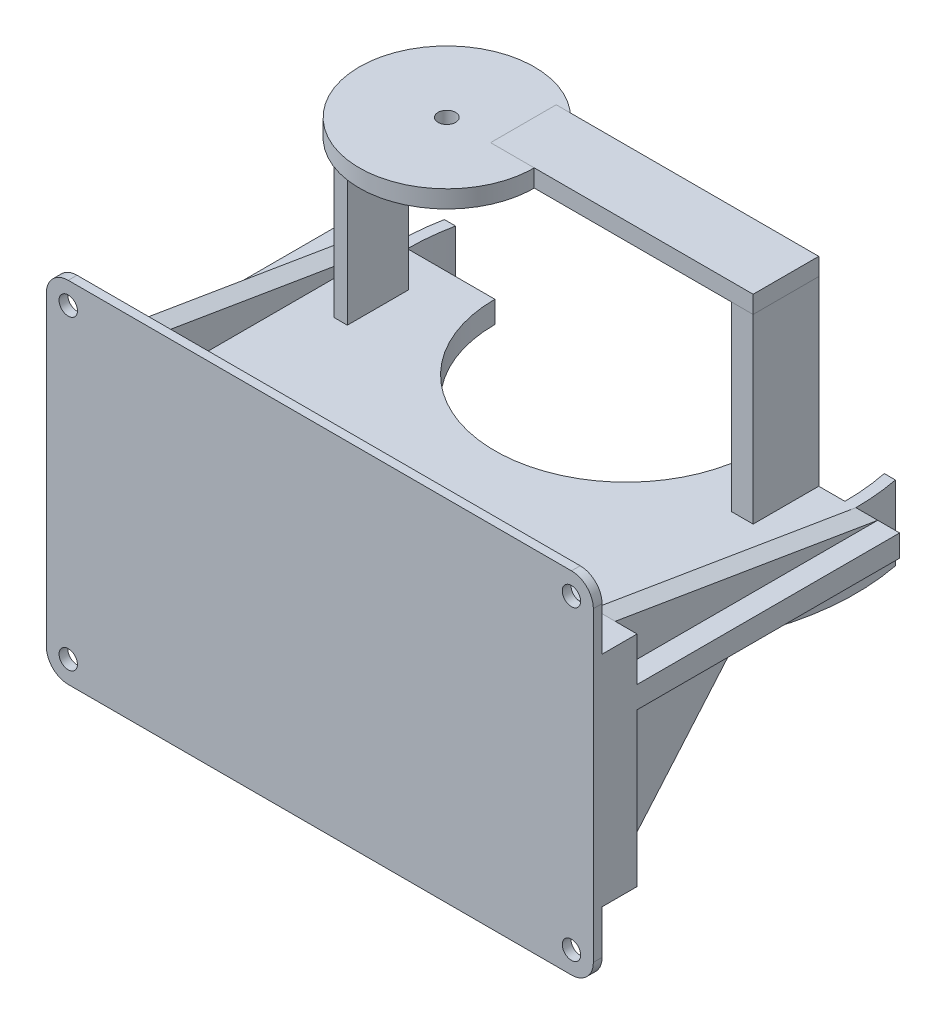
ISO-10303-21;
HEADER;
FILE_DESCRIPTION(('STEP AP214'),'2;1');
FILE_NAME('part.step','',(''),(''),'','','');
FILE_SCHEMA(('AUTOMOTIVE_DESIGN { 1 0 10303 214 1 1 1 1 }'));
ENDSEC;
DATA;
#1=APPLICATION_CONTEXT('core data for automotive mechanical design processes');
#2=APPLICATION_PROTOCOL_DEFINITION('international standard','automotive_design',2000,#1);
#3=PRODUCT_CONTEXT('',#1,'mechanical');
#4=PRODUCT('Part','Part','',(#3));
#5=PRODUCT_RELATED_PRODUCT_CATEGORY('part','',(#4));
#6=PRODUCT_DEFINITION_FORMATION('','',#4);
#7=PRODUCT_DEFINITION_CONTEXT('part definition',#1,'design');
#8=PRODUCT_DEFINITION('design','',#6,#7);
#9=PRODUCT_DEFINITION_SHAPE('','',#8);
#10=(LENGTH_UNIT() NAMED_UNIT(*) SI_UNIT(.MILLI.,.METRE.));
#11=(NAMED_UNIT(*) PLANE_ANGLE_UNIT() SI_UNIT($,.RADIAN.));
#12=(NAMED_UNIT(*) SI_UNIT($,.STERADIAN.) SOLID_ANGLE_UNIT());
#13=UNCERTAINTY_MEASURE_WITH_UNIT(LENGTH_MEASURE(1.E-05),#10,'distance_accuracy_value','');
#14=(GEOMETRIC_REPRESENTATION_CONTEXT(3) GLOBAL_UNCERTAINTY_ASSIGNED_CONTEXT((#13)) GLOBAL_UNIT_ASSIGNED_CONTEXT((#10,
#11,#12)) REPRESENTATION_CONTEXT('',''));
#15=CARTESIAN_POINT('',(0.,0.,0.));
#16=DIRECTION('',(0.,0.,1.));
#17=DIRECTION('',(1.,0.,0.));
#18=AXIS2_PLACEMENT_3D('',#15,#16,#17);
#19=CARTESIAN_POINT('',(-15.9807621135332,56.5,-60.0000000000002));
#20=DIRECTION('',(-1.,0.,0.));
#21=DIRECTION('',(0.,0.,1.));
#22=AXIS2_PLACEMENT_3D('',#19,#20,#21);
#23=PLANE('',#22);
#24=DIRECTION('',(0.,0.,1.));
#25=VECTOR('',#24,1.);
#26=CARTESIAN_POINT('',(-15.9807621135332,60.5,-60.0000000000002));
#27=LINE('',#26,#25);
#28=CARTESIAN_POINT('',(-15.9807621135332,60.5,-60.0000000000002));
#29=VERTEX_POINT('',#28);
#30=CARTESIAN_POINT('',(-15.9807621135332,60.5,-45.0000000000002));
#31=VERTEX_POINT('',#30);
#32=EDGE_CURVE('E115',#29,#31,#27,.T.);
#33=ORIENTED_EDGE('',*,*,#32,.F.);
#34=DIRECTION('',(0.,1.,0.));
#35=VECTOR('',#34,1.);
#36=CARTESIAN_POINT('',(-15.9807621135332,56.5,-60.0000000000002));
#37=LINE('',#36,#35);
#38=CARTESIAN_POINT('',(-15.9807621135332,56.5,-60.0000000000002));
#39=VERTEX_POINT('',#38);
#40=EDGE_CURVE('E12',#39,#29,#37,.T.);
#41=ORIENTED_EDGE('',*,*,#40,.F.);
#42=DIRECTION('',(0.,0.,1.));
#43=VECTOR('',#42,1.);
#44=CARTESIAN_POINT('',(-15.9807621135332,56.5,-60.0000000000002));
#45=LINE('',#44,#43);
#46=CARTESIAN_POINT('',(-15.9807621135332,56.5,-45.0000000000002));
#47=VERTEX_POINT('',#46);
#48=EDGE_CURVE('E109',#39,#47,#45,.T.);
#49=ORIENTED_EDGE('',*,*,#48,.T.);
#50=DIRECTION('',(0.,1.,0.));
#51=VECTOR('',#50,1.);
#52=CARTESIAN_POINT('',(-15.9807621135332,56.5,-45.0000000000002));
#53=LINE('',#52,#51);
#54=EDGE_CURVE('E54',#47,#31,#53,.T.);
#55=ORIENTED_EDGE('',*,*,#54,.T.);
#56=EDGE_LOOP('',(#33,#41,#49,#55));
#57=FACE_BOUND('',#56,.T.);
#58=ADVANCED_FACE('F51',(#57),#23,.T.);
#59=CARTESIAN_POINT('',(44.0192378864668,56.5,-60.0000000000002));
#60=DIRECTION('',(0.,0.,-1.));
#61=DIRECTION('',(-1.,0.,0.));
#62=AXIS2_PLACEMENT_3D('',#59,#60,#61);
#63=PLANE('',#62);
#64=DIRECTION('',(-1.,0.,0.));
#65=VECTOR('',#64,1.);
#66=CARTESIAN_POINT('',(44.0192378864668,60.5,-60.0000000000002));
#67=LINE('',#66,#65);
#68=CARTESIAN_POINT('',(44.0192378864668,60.5,-60.0000000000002));
#69=VERTEX_POINT('',#68);
#70=EDGE_CURVE('E111',#69,#29,#67,.T.);
#71=ORIENTED_EDGE('',*,*,#70,.F.);
#72=DIRECTION('',(0.,1.,0.));
#73=VECTOR('',#72,1.);
#74=CARTESIAN_POINT('',(44.0192378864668,56.5,-60.0000000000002));
#75=LINE('',#74,#73);
#76=CARTESIAN_POINT('',(44.0192378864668,56.5,-60.0000000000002));
#77=VERTEX_POINT('',#76);
#78=EDGE_CURVE('E60',#77,#69,#75,.T.);
#79=ORIENTED_EDGE('',*,*,#78,.F.);
#80=DIRECTION('',(-1.,0.,0.));
#81=VECTOR('',#80,1.);
#82=CARTESIAN_POINT('',(44.0192378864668,56.5,-60.0000000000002));
#83=LINE('',#82,#81);
#84=EDGE_CURVE('E106',#77,#39,#83,.T.);
#85=ORIENTED_EDGE('',*,*,#84,.T.);
#86=ORIENTED_EDGE('',*,*,#40,.T.);
#87=EDGE_LOOP('',(#71,#79,#85,#86));
#88=FACE_BOUND('',#87,.T.);
#89=ADVANCED_FACE('F125',(#88),#63,.T.);
#90=CARTESIAN_POINT('',(44.0192378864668,56.5,-60.0000000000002));
#91=DIRECTION('',(1.,0.,0.));
#92=DIRECTION('',(0.,1.,0.));
#93=AXIS2_PLACEMENT_3D('',#90,#91,#92);
#94=PLANE('',#93);
#95=DIRECTION('',(0.,0.,-1.));
#96=VECTOR('',#95,1.);
#97=CARTESIAN_POINT('',(44.0192378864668,60.5,-60.0000000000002));
#98=LINE('',#97,#96);
#99=CARTESIAN_POINT('',(44.0192378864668,60.5,-45.0000000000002));
#100=VERTEX_POINT('',#99);
#101=EDGE_CURVE('E101',#100,#69,#98,.T.);
#102=ORIENTED_EDGE('',*,*,#101,.F.);
#103=DIRECTION('',(0.,1.,0.));
#104=VECTOR('',#103,1.);
#105=CARTESIAN_POINT('',(44.0192378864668,56.5,-45.0000000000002));
#106=LINE('',#105,#104);
#107=CARTESIAN_POINT('',(44.0192378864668,56.5,-45.0000000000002));
#108=VERTEX_POINT('',#107);
#109=EDGE_CURVE('E96',#108,#100,#106,.T.);
#110=ORIENTED_EDGE('',*,*,#109,.F.);
#111=DIRECTION('',(0.,0.,-1.));
#112=VECTOR('',#111,1.);
#113=CARTESIAN_POINT('',(44.0192378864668,56.5,-60.0000000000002));
#114=LINE('',#113,#112);
#115=EDGE_CURVE('E99',#108,#77,#114,.T.);
#116=ORIENTED_EDGE('',*,*,#115,.T.);
#117=ORIENTED_EDGE('',*,*,#78,.T.);
#118=EDGE_LOOP('',(#102,#110,#116,#117));
#119=FACE_BOUND('',#118,.T.);
#120=ADVANCED_FACE('F98',(#119),#94,.T.);
#121=CARTESIAN_POINT('',(44.0192378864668,56.5,-45.0000000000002));
#122=DIRECTION('',(0.,0.,1.));
#123=DIRECTION('',(1.,0.,0.));
#124=AXIS2_PLACEMENT_3D('',#121,#122,#123);
#125=PLANE('',#124);
#126=DIRECTION('',(1.,0.,0.));
#127=VECTOR('',#126,1.);
#128=CARTESIAN_POINT('',(44.0192378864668,60.5,-45.0000000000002));
#129=LINE('',#128,#127);
#130=EDGE_CURVE('E118',#31,#100,#129,.T.);
#131=ORIENTED_EDGE('',*,*,#130,.F.);
#132=ORIENTED_EDGE('',*,*,#54,.F.);
#133=DIRECTION('',(1.,0.,0.));
#134=VECTOR('',#133,1.);
#135=CARTESIAN_POINT('',(44.0192378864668,56.5,-45.0000000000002));
#136=LINE('',#135,#134);
#137=EDGE_CURVE('E105',#47,#108,#136,.T.);
#138=ORIENTED_EDGE('',*,*,#137,.T.);
#139=ORIENTED_EDGE('',*,*,#109,.T.);
#140=EDGE_LOOP('',(#131,#132,#138,#139));
#141=FACE_BOUND('',#140,.T.);
#142=ADVANCED_FACE('F108',(#141),#125,.T.);
#143=CARTESIAN_POINT('',(0.,56.5,0.));
#144=DIRECTION('',(0.,-1.,0.));
#145=DIRECTION('',(1.,0.,0.));
#146=AXIS2_PLACEMENT_3D('',#143,#144,#145);
#147=PLANE('',#146);
#148=ORIENTED_EDGE('',*,*,#48,.F.);
#149=ORIENTED_EDGE('',*,*,#84,.F.);
#150=ORIENTED_EDGE('',*,*,#115,.F.);
#151=ORIENTED_EDGE('',*,*,#137,.F.);
#152=EDGE_LOOP('',(#148,#149,#150,#151));
#153=FACE_BOUND('',#152,.T.);
#154=ADVANCED_FACE('F104',(#153),#147,.T.);
#155=CARTESIAN_POINT('',(0.,60.5,0.));
#156=DIRECTION('',(0.,-1.,0.));
#157=DIRECTION('',(1.,0.,0.));
#158=AXIS2_PLACEMENT_3D('',#155,#156,#157);
#159=PLANE('',#158);
#160=ORIENTED_EDGE('',*,*,#32,.T.);
#161=ORIENTED_EDGE('',*,*,#130,.T.);
#162=ORIENTED_EDGE('',*,*,#101,.T.);
#163=ORIENTED_EDGE('',*,*,#70,.T.);
#164=EDGE_LOOP('',(#160,#161,#162,#163));
#165=FACE_BOUND('',#164,.T.);
#166=ADVANCED_FACE('F124',(#165),#159,.F.);
#167=CLOSED_SHELL('',(#58,#89,#120,#142,#154,#166));
#168=MANIFOLD_SOLID_BREP('B2',#167);
#169=CARTESIAN_POINT('',(-25.9807621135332,48.5,-45.0000000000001));
#170=DIRECTION('',(0.,-1.,0.));
#171=DIRECTION('',(1.,0.,0.));
#172=AXIS2_PLACEMENT_3D('',#169,#170,#171);
#173=CYLINDRICAL_SURFACE('',#172,2.);
#174=CARTESIAN_POINT('',(-25.9807621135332,60.5,-45.0000000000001));
#175=DIRECTION('',(0.,1.,0.));
#176=DIRECTION('',(-1.,0.,0.));
#177=AXIS2_PLACEMENT_3D('',#174,#175,#176);
#178=CIRCLE('',#177,2.);
#179=CARTESIAN_POINT('',(-27.9807621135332,60.5,-45.0000000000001));
#180=VERTEX_POINT('',#179);
#181=EDGE_CURVE('E1150',#180,#180,#178,.T.);
#182=ORIENTED_EDGE('',*,*,#181,.T.);
#183=EDGE_LOOP('',(#182));
#184=FACE_BOUND('',#183,.T.);
#185=CARTESIAN_POINT('',(-25.9807621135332,48.9571773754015,-45.0000000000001));
#186=DIRECTION('',(0.,-1.,0.));
#187=DIRECTION('',(0.,0.,-1.));
#188=AXIS2_PLACEMENT_3D('',#185,#186,#187);
#189=CIRCLE('',#188,2.);
#190=CARTESIAN_POINT('',(-25.9807621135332,48.9571773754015,-47.0000000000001));
#191=VERTEX_POINT('',#190);
#192=EDGE_CURVE('E523',#191,#191,#189,.T.);
#193=ORIENTED_EDGE('',*,*,#192,.T.);
#194=EDGE_LOOP('',(#193));
#195=FACE_BOUND('',#194,.T.);
#196=ADVANCED_FACE('F175',(#184,#195),#173,.F.);
#197=CARTESIAN_POINT('',(-25.9807621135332,48.5,-45.0000000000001));
#198=DIRECTION('',(0.,-1.,0.));
#199=DIRECTION('',(1.,0.,0.));
#200=AXIS2_PLACEMENT_3D('',#197,#198,#199);
#201=CYLINDRICAL_SURFACE('',#200,3.99999999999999);
#202=CARTESIAN_POINT('',(-25.9807621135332,56.5,-45.0000000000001));
#203=DIRECTION('',(0.,1.,0.));
#204=DIRECTION('',(-1.,0.,0.));
#205=AXIS2_PLACEMENT_3D('',#202,#203,#204);
#206=CIRCLE('',#205,3.99999999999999);
#207=CARTESIAN_POINT('',(-29.9807621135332,56.5,-45.0000000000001));
#208=VERTEX_POINT('',#207);
#209=EDGE_CURVE('E184',#208,#208,#206,.T.);
#210=ORIENTED_EDGE('',*,*,#209,.F.);
#211=EDGE_LOOP('',(#210));
#212=FACE_BOUND('',#211,.T.);
#213=CARTESIAN_POINT('',(-25.9807621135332,48.9571773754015,-45.0000000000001));
#214=DIRECTION('',(0.,-1.,0.));
#215=DIRECTION('',(0.,0.,-1.));
#216=AXIS2_PLACEMENT_3D('',#213,#214,#215);
#217=CIRCLE('',#216,3.99999999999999);
#218=CARTESIAN_POINT('',(-25.9807621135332,48.9571773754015,-49.0000000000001));
#219=VERTEX_POINT('',#218);
#220=EDGE_CURVE('E179',#219,#219,#217,.T.);
#221=ORIENTED_EDGE('',*,*,#220,.F.);
#222=EDGE_LOOP('',(#221));
#223=FACE_BOUND('',#222,.T.);
#224=ADVANCED_FACE('F177',(#212,#223),#201,.T.);
#225=CARTESIAN_POINT('',(-25.9807621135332,56.5,-45.0000000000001));
#226=DIRECTION('',(0.,1.,0.));
#227=DIRECTION('',(-1.,0.,0.));
#228=AXIS2_PLACEMENT_3D('',#225,#226,#227);
#229=PLANE('',#228);
#230=ORIENTED_EDGE('',*,*,#209,.T.);
#231=EDGE_LOOP('',(#230));
#232=FACE_BOUND('',#231,.T.);
#233=DIRECTION('',(1.,0.,0.));
#234=VECTOR('',#233,1.);
#235=CARTESIAN_POINT('',(-41.7157561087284,56.5,-52.0000000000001));
#236=LINE('',#235,#234);
#237=CARTESIAN_POINT('',(-44.7157561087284,56.5,-52.0000000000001));
#238=VERTEX_POINT('',#237);
#239=CARTESIAN_POINT('',(-41.7157561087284,56.5,-52.0000000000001));
#240=VERTEX_POINT('',#239);
#241=EDGE_CURVE('E544',#238,#240,#236,.T.);
#242=ORIENTED_EDGE('',*,*,#241,.F.);
#243=CARTESIAN_POINT('',(-25.9807621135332,56.5,-45.0000000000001));
#244=DIRECTION('',(0.,1.,0.));
#245=DIRECTION('',(-1.,0.,0.));
#246=AXIS2_PLACEMENT_3D('',#243,#244,#245);
#247=CIRCLE('',#246,20.);
#248=CARTESIAN_POINT('',(-44.7157561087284,56.5,-38.0000000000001));
#249=VERTEX_POINT('',#248);
#250=EDGE_CURVE('E1157',#249,#238,#247,.T.);
#251=ORIENTED_EDGE('',*,*,#250,.F.);
#252=DIRECTION('',(-1.,0.,0.));
#253=VECTOR('',#252,1.);
#254=CARTESIAN_POINT('',(-41.7157561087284,56.5,-38.0000000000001));
#255=LINE('',#254,#253);
#256=CARTESIAN_POINT('',(-41.7157561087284,56.5,-38.0000000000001));
#257=VERTEX_POINT('',#256);
#258=EDGE_CURVE('E196',#257,#249,#255,.T.);
#259=ORIENTED_EDGE('',*,*,#258,.F.);
#260=DIRECTION('',(0.,0.,1.));
#261=VECTOR('',#260,1.);
#262=CARTESIAN_POINT('',(-41.7157561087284,56.5,-38.0000000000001));
#263=LINE('',#262,#261);
#264=EDGE_CURVE('E191',#240,#257,#263,.T.);
#265=ORIENTED_EDGE('',*,*,#264,.F.);
#266=EDGE_LOOP('',(#242,#251,#259,#265));
#267=FACE_BOUND('',#266,.T.);
#268=ADVANCED_FACE('F632',(#232,#267),#229,.F.);
#269=CARTESIAN_POINT('',(-25.9807621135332,56.5,-45.0000000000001));
#270=DIRECTION('',(0.,1.,0.));
#271=DIRECTION('',(-1.,0.,0.));
#272=AXIS2_PLACEMENT_3D('',#269,#270,#271);
#273=CYLINDRICAL_SURFACE('',#272,20.);
#274=ORIENTED_EDGE('',*,*,#250,.T.);
#275=DIRECTION('',(0.,1.,0.));
#276=VECTOR('',#275,1.);
#277=CARTESIAN_POINT('',(-44.7157561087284,-40.002,-52.0000000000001));
#278=LINE('',#277,#276);
#279=CARTESIAN_POINT('',(-44.7157561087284,15.,-52.0000000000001));
#280=VERTEX_POINT('',#279);
#281=EDGE_CURVE('E550',#280,#238,#278,.T.);
#282=ORIENTED_EDGE('',*,*,#281,.F.);
#283=CARTESIAN_POINT('',(-25.9807621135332,15.,-45.0000000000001));
#284=DIRECTION('',(0.,-1.,0.));
#285=DIRECTION('',(1.,0.,0.));
#286=AXIS2_PLACEMENT_3D('',#283,#284,#285);
#287=CIRCLE('',#286,20.);
#288=CARTESIAN_POINT('',(-44.7157561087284,15.,-38.0000000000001));
#289=VERTEX_POINT('',#288);
#290=EDGE_CURVE('E554',#289,#280,#287,.T.);
#291=ORIENTED_EDGE('',*,*,#290,.F.);
#292=DIRECTION('',(0.,1.,0.));
#293=VECTOR('',#292,1.);
#294=CARTESIAN_POINT('',(-44.7157561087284,-40.002,-38.0000000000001));
#295=LINE('',#294,#293);
#296=EDGE_CURVE('E549',#289,#249,#295,.T.);
#297=ORIENTED_EDGE('',*,*,#296,.T.);
#298=EDGE_LOOP('',(#274,#282,#291,#297));
#299=FACE_BOUND('',#298,.T.);
#300=CARTESIAN_POINT('',(-25.9807621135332,60.5,-45.0000000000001));
#301=DIRECTION('',(0.,1.,0.));
#302=DIRECTION('',(-1.,0.,0.));
#303=AXIS2_PLACEMENT_3D('',#300,#301,#302);
#304=CIRCLE('',#303,20.);
#305=CARTESIAN_POINT('',(-45.9807621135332,60.5,-45.0000000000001));
#306=VERTEX_POINT('',#305);
#307=EDGE_CURVE('E1154',#306,#306,#304,.T.);
#308=ORIENTED_EDGE('',*,*,#307,.F.);
#309=EDGE_LOOP('',(#308));
#310=FACE_BOUND('',#309,.T.);
#311=ADVANCED_FACE('F637',(#299,#310),#273,.T.);
#312=CARTESIAN_POINT('',(-25.9807621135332,60.5,-45.0000000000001));
#313=DIRECTION('',(0.,1.,0.));
#314=DIRECTION('',(-1.,0.,0.));
#315=AXIS2_PLACEMENT_3D('',#312,#313,#314);
#316=PLANE('',#315);
#317=ORIENTED_EDGE('',*,*,#181,.F.);
#318=EDGE_LOOP('',(#317));
#319=FACE_BOUND('',#318,.T.);
#320=ORIENTED_EDGE('',*,*,#307,.T.);
#321=EDGE_LOOP('',(#320));
#322=FACE_BOUND('',#321,.T.);
#323=ADVANCED_FACE('F640',(#319,#322),#316,.T.);
#324=CARTESIAN_POINT('',(-62.5,15.,-60.));
#325=DIRECTION('',(0.,-1.,0.));
#326=DIRECTION('',(1.,0.,0.));
#327=AXIS2_PLACEMENT_3D('',#324,#325,#326);
#328=PLANE('',#327);
#329=CARTESIAN_POINT('',(0.,15.,-60.));
#330=DIRECTION('',(0.,1.,0.));
#331=DIRECTION('',(-1.,0.,0.));
#332=AXIS2_PLACEMENT_3D('',#329,#330,#331);
#333=CIRCLE('',#332,30.);
#334=CARTESIAN_POINT('',(-30.,15.,-60.));
#335=VERTEX_POINT('',#334);
#336=CARTESIAN_POINT('',(30.,15.,-60.));
#337=VERTEX_POINT('',#336);
#338=EDGE_CURVE('E49',#335,#337,#333,.T.);
#339=ORIENTED_EDGE('',*,*,#338,.F.);
#340=DIRECTION('',(1.,0.,0.));
#341=VECTOR('',#340,1.);
#342=CARTESIAN_POINT('',(-62.5,15.,-60.));
#343=LINE('',#342,#341);
#344=CARTESIAN_POINT('',(-50.,15.,-60.));
#345=VERTEX_POINT('',#344);
#346=EDGE_CURVE('E1043',#345,#335,#343,.T.);
#347=ORIENTED_EDGE('',*,*,#346,.F.);
#348=CARTESIAN_POINT('',(0.,15.,-60.));
#349=DIRECTION('',(0.,-1.,0.));
#350=DIRECTION('',(1.,0.,0.));
#351=AXIS2_PLACEMENT_3D('',#348,#349,#350);
#352=CIRCLE('',#351,50.);
#353=CARTESIAN_POINT('',(-48.9897948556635,15.,-70.));
#354=VERTEX_POINT('',#353);
#355=EDGE_CURVE('E1877',#345,#354,#352,.T.);
#356=ORIENTED_EDGE('',*,*,#355,.T.);
#357=DIRECTION('',(1.,0.,0.));
#358=VECTOR('',#357,1.);
#359=CARTESIAN_POINT('',(0.,15.,-70.));
#360=LINE('',#359,#358);
#361=CARTESIAN_POINT('',(-51.5388203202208,15.,-70.));
#362=VERTEX_POINT('',#361);
#363=EDGE_CURVE('E842',#362,#354,#360,.T.);
#364=ORIENTED_EDGE('',*,*,#363,.F.);
#365=CARTESIAN_POINT('',(0.,15.,-60.));
#366=DIRECTION('',(0.,-1.,0.));
#367=DIRECTION('',(1.,0.,0.));
#368=AXIS2_PLACEMENT_3D('',#365,#366,#367);
#369=CIRCLE('',#368,52.5);
#370=CARTESIAN_POINT('',(-52.5,15.,-60.));
#371=VERTEX_POINT('',#370);
#372=EDGE_CURVE('E832',#371,#362,#369,.T.);
#373=ORIENTED_EDGE('',*,*,#372,.F.);
#374=DIRECTION('',(0.,0.,1.));
#375=VECTOR('',#374,1.);
#376=CARTESIAN_POINT('',(-52.5,15.,0.));
#377=LINE('',#376,#375);
#378=CARTESIAN_POINT('',(-52.5,15.,0.));
#379=VERTEX_POINT('',#378);
#380=EDGE_CURVE('E805',#371,#379,#377,.T.);
#381=ORIENTED_EDGE('',*,*,#380,.T.);
#382=DIRECTION('',(1.,0.,0.));
#383=VECTOR('',#382,1.);
#384=CARTESIAN_POINT('',(-62.5,15.,0.));
#385=LINE('',#384,#383);
#386=CARTESIAN_POINT('',(52.5,15.,0.));
#387=VERTEX_POINT('',#386);
#388=EDGE_CURVE('E1052',#379,#387,#385,.T.);
#389=ORIENTED_EDGE('',*,*,#388,.T.);
#390=DIRECTION('',(0.,0.,1.));
#391=VECTOR('',#390,1.);
#392=CARTESIAN_POINT('',(52.5,15.,0.));
#393=LINE('',#392,#391);
#394=CARTESIAN_POINT('',(52.5,15.,-60.));
#395=VERTEX_POINT('',#394);
#396=EDGE_CURVE('E901',#395,#387,#393,.T.);
#397=ORIENTED_EDGE('',*,*,#396,.F.);
#398=CARTESIAN_POINT('',(51.5388203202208,15.,-70.));
#399=VERTEX_POINT('',#398);
#400=EDGE_CURVE('E843',#399,#395,#369,.T.);
#401=ORIENTED_EDGE('',*,*,#400,.F.);
#402=DIRECTION('',(1.,0.,0.));
#403=VECTOR('',#402,1.);
#404=CARTESIAN_POINT('',(0.,15.,-70.));
#405=LINE('',#404,#403);
#406=CARTESIAN_POINT('',(48.9897948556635,15.,-70.));
#407=VERTEX_POINT('',#406);
#408=EDGE_CURVE('E844',#407,#399,#405,.T.);
#409=ORIENTED_EDGE('',*,*,#408,.F.);
#410=CARTESIAN_POINT('',(50.,15.,-60.));
#411=VERTEX_POINT('',#410);
#412=EDGE_CURVE('E846',#407,#411,#352,.T.);
#413=ORIENTED_EDGE('',*,*,#412,.T.);
#414=CARTESIAN_POINT('',(44.0192378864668,15.,-60.));
#415=VERTEX_POINT('',#414);
#416=EDGE_CURVE('E1044',#415,#411,#343,.T.);
#417=ORIENTED_EDGE('',*,*,#416,.F.);
#418=DIRECTION('',(0.,0.,1.));
#419=VECTOR('',#418,1.);
#420=CARTESIAN_POINT('',(44.0192378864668,15.,-60.0000000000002));
#421=LINE('',#420,#419);
#422=CARTESIAN_POINT('',(44.0192378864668,15.,-45.0000000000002));
#423=VERTEX_POINT('',#422);
#424=EDGE_CURVE('E504',#415,#423,#421,.T.);
#425=ORIENTED_EDGE('',*,*,#424,.T.);
#426=DIRECTION('',(-1.,0.,0.));
#427=VECTOR('',#426,1.);
#428=CARTESIAN_POINT('',(44.0192378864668,15.,-45.0000000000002));
#429=LINE('',#428,#427);
#430=CARTESIAN_POINT('',(39.0192378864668,15.,-45.0000000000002));
#431=VERTEX_POINT('',#430);
#432=EDGE_CURVE('E539',#423,#431,#429,.T.);
#433=ORIENTED_EDGE('',*,*,#432,.T.);
#434=DIRECTION('',(0.,0.,-1.));
#435=VECTOR('',#434,1.);
#436=CARTESIAN_POINT('',(39.0192378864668,15.,-60.0000000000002));
#437=LINE('',#436,#435);
#438=CARTESIAN_POINT('',(39.0192378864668,15.,-60.0000000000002));
#439=VERTEX_POINT('',#438);
#440=EDGE_CURVE('E535',#431,#439,#437,.T.);
#441=ORIENTED_EDGE('',*,*,#440,.T.);
#442=EDGE_CURVE('E1251',#337,#439,#343,.T.);
#443=ORIENTED_EDGE('',*,*,#442,.F.);
#444=EDGE_LOOP('',(#339,#347,#356,#364,#373,#381,#389,#397,#401,#409,#413,#417,#425,#433,#441,#443));
#445=FACE_BOUND('',#444,.T.);
#446=ORIENTED_EDGE('',*,*,#290,.T.);
#447=DIRECTION('',(1.,0.,0.));
#448=VECTOR('',#447,1.);
#449=CARTESIAN_POINT('',(-41.7157561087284,15.,-52.0000000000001));
#450=LINE('',#449,#448);
#451=CARTESIAN_POINT('',(-41.7157561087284,15.,-52.0000000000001));
#452=VERTEX_POINT('',#451);
#453=EDGE_CURVE('E561',#280,#452,#450,.T.);
#454=ORIENTED_EDGE('',*,*,#453,.T.);
#455=DIRECTION('',(0.,0.,1.));
#456=VECTOR('',#455,1.);
#457=CARTESIAN_POINT('',(-41.7157561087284,15.,-38.0000000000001));
#458=LINE('',#457,#456);
#459=CARTESIAN_POINT('',(-41.7157561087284,15.,-38.0000000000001));
#460=VERTEX_POINT('',#459);
#461=EDGE_CURVE('E563',#452,#460,#458,.T.);
#462=ORIENTED_EDGE('',*,*,#461,.T.);
#463=DIRECTION('',(-1.,0.,0.));
#464=VECTOR('',#463,1.);
#465=CARTESIAN_POINT('',(-41.7157561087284,15.,-38.0000000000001));
#466=LINE('',#465,#464);
#467=EDGE_CURVE('E538',#460,#289,#466,.T.);
#468=ORIENTED_EDGE('',*,*,#467,.T.);
#469=EDGE_LOOP('',(#446,#454,#462,#468));
#470=FACE_BOUND('',#469,.T.);
#471=ADVANCED_FACE('F644',(#445,#470),#328,.F.);
#472=CARTESIAN_POINT('',(0.,0.,-60.));
#473=DIRECTION('',(0.,0.,1.));
#474=DIRECTION('',(1.,0.,0.));
#475=AXIS2_PLACEMENT_3D('',#472,#473,#474);
#476=PLANE('',#475);
#477=ORIENTED_EDGE('',*,*,#346,.T.);
#478=DIRECTION('',(0.,-1.,0.));
#479=VECTOR('',#478,1.);
#480=CARTESIAN_POINT('',(-30.,20.,-60.));
#481=LINE('',#480,#479);
#482=CARTESIAN_POINT('',(-30.,9.99999999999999,-60.));
#483=VERTEX_POINT('',#482);
#484=EDGE_CURVE('E1147',#335,#483,#481,.T.);
#485=ORIENTED_EDGE('',*,*,#484,.T.);
#486=DIRECTION('',(-1.,0.,0.));
#487=VECTOR('',#486,1.);
#488=CARTESIAN_POINT('',(-62.5,10.,-60.));
#489=LINE('',#488,#487);
#490=CARTESIAN_POINT('',(-50.,10.,-60.));
#491=VERTEX_POINT('',#490);
#492=EDGE_CURVE('E1038',#483,#491,#489,.T.);
#493=ORIENTED_EDGE('',*,*,#492,.T.);
#494=DIRECTION('',(0.,1.,0.));
#495=VECTOR('',#494,1.);
#496=CARTESIAN_POINT('',(-50.,-2.,-60.));
#497=LINE('',#496,#495);
#498=EDGE_CURVE('E1140',#491,#345,#497,.T.);
#499=ORIENTED_EDGE('',*,*,#498,.T.);
#500=EDGE_LOOP('',(#477,#485,#493,#499));
#501=FACE_BOUND('',#500,.T.);
#502=ADVANCED_FACE('F713',(#501),#476,.F.);
#503=CARTESIAN_POINT('',(-62.5,10.,-60.));
#504=DIRECTION('',(0.,1.,0.));
#505=DIRECTION('',(-1.,0.,0.));
#506=AXIS2_PLACEMENT_3D('',#503,#504,#505);
#507=PLANE('',#506);
#508=ORIENTED_EDGE('',*,*,#492,.F.);
#509=CARTESIAN_POINT('',(0.,9.99999999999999,-60.));
#510=DIRECTION('',(0.,-1.,0.));
#511=DIRECTION('',(1.,0.,0.));
#512=AXIS2_PLACEMENT_3D('',#509,#510,#511);
#513=CIRCLE('',#512,30.);
#514=CARTESIAN_POINT('',(30.,9.99999999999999,-60.));
#515=VERTEX_POINT('',#514);
#516=EDGE_CURVE('E547',#515,#483,#513,.T.);
#517=ORIENTED_EDGE('',*,*,#516,.F.);
#518=CARTESIAN_POINT('',(50.,9.99999999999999,-60.));
#519=VERTEX_POINT('',#518);
#520=EDGE_CURVE('E1037',#519,#515,#489,.T.);
#521=ORIENTED_EDGE('',*,*,#520,.F.);
#522=CARTESIAN_POINT('',(0.,9.99999999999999,-60.));
#523=DIRECTION('',(0.,1.,0.));
#524=DIRECTION('',(-1.,0.,0.));
#525=AXIS2_PLACEMENT_3D('',#522,#523,#524);
#526=CIRCLE('',#525,50.);
#527=EDGE_CURVE('E865',#519,#491,#526,.F.);
#528=ORIENTED_EDGE('',*,*,#527,.T.);
#529=EDGE_LOOP('',(#508,#517,#521,#528));
#530=FACE_BOUND('',#529,.T.);
#531=ADVANCED_FACE('F705',(#530),#507,.F.);
#532=DIRECTION('',(0.,1.,0.));
#533=VECTOR('',#532,1.);
#534=CARTESIAN_POINT('',(52.5,-2.00000000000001,-60.));
#535=LINE('',#534,#533);
#536=CARTESIAN_POINT('',(52.5,9.99999999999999,-60.));
#537=VERTEX_POINT('',#536);
#538=EDGE_CURVE('E863',#395,#537,#535,.F.);
#539=ORIENTED_EDGE('',*,*,#538,.F.);
#540=DIRECTION('',(1.,0.,0.));
#541=VECTOR('',#540,1.);
#542=CARTESIAN_POINT('',(52.5,15.,-60.));
#543=LINE('',#542,#541);
#544=CARTESIAN_POINT('',(57.5,15.,-60.));
#545=VERTEX_POINT('',#544);
#546=EDGE_CURVE('E898',#395,#545,#543,.T.);
#547=ORIENTED_EDGE('',*,*,#546,.T.);
#548=CARTESIAN_POINT('',(62.5,15.,-60.));
#549=VERTEX_POINT('',#548);
#550=EDGE_CURVE('E1040',#545,#549,#343,.T.);
#551=ORIENTED_EDGE('',*,*,#550,.T.);
#552=DIRECTION('',(0.,-1.,0.));
#553=VECTOR('',#552,1.);
#554=CARTESIAN_POINT('',(62.5,15.,-60.));
#555=LINE('',#554,#553);
#556=CARTESIAN_POINT('',(62.5,9.99999999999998,-60.));
#557=VERTEX_POINT('',#556);
#558=EDGE_CURVE('E1028',#549,#557,#555,.T.);
#559=ORIENTED_EDGE('',*,*,#558,.T.);
#560=EDGE_CURVE('E1033',#557,#537,#489,.T.);
#561=ORIENTED_EDGE('',*,*,#560,.T.);
#562=EDGE_LOOP('',(#539,#547,#551,#559,#561));
#563=FACE_BOUND('',#562,.T.);
#564=ADVANCED_FACE('F1214',(#563),#476,.F.);
#565=DIRECTION('',(0.,1.,0.));
#566=VECTOR('',#565,1.);
#567=CARTESIAN_POINT('',(-52.5,-2.,-60.));
#568=LINE('',#567,#566);
#569=CARTESIAN_POINT('',(-52.5,10.,-60.));
#570=VERTEX_POINT('',#569);
#571=EDGE_CURVE('E819',#570,#371,#568,.T.);
#572=ORIENTED_EDGE('',*,*,#571,.F.);
#573=CARTESIAN_POINT('',(-62.5,10.,-60.));
#574=VERTEX_POINT('',#573);
#575=EDGE_CURVE('E1031',#570,#574,#489,.T.);
#576=ORIENTED_EDGE('',*,*,#575,.T.);
#577=DIRECTION('',(0.,1.,0.));
#578=VECTOR('',#577,1.);
#579=CARTESIAN_POINT('',(-62.5,15.,-60.));
#580=LINE('',#579,#578);
#581=CARTESIAN_POINT('',(-62.5,15.,-60.));
#582=VERTEX_POINT('',#581);
#583=EDGE_CURVE('E1036',#574,#582,#580,.T.);
#584=ORIENTED_EDGE('',*,*,#583,.T.);
#585=CARTESIAN_POINT('',(-57.5,15.,-60.));
#586=VERTEX_POINT('',#585);
#587=EDGE_CURVE('E822',#582,#586,#343,.T.);
#588=ORIENTED_EDGE('',*,*,#587,.T.);
#589=DIRECTION('',(-1.,0.,0.));
#590=VECTOR('',#589,1.);
#591=CARTESIAN_POINT('',(-52.5,15.,-60.));
#592=LINE('',#591,#590);
#593=EDGE_CURVE('E817',#371,#586,#592,.T.);
#594=ORIENTED_EDGE('',*,*,#593,.F.);
#595=EDGE_LOOP('',(#572,#576,#584,#588,#594));
#596=FACE_BOUND('',#595,.T.);
#597=ADVANCED_FACE('F714',(#596),#476,.F.);
#598=CARTESIAN_POINT('',(0.,0.,0.));
#599=DIRECTION('',(0.,0.,-1.));
#600=DIRECTION('',(-1.,0.,0.));
#601=AXIS2_PLACEMENT_3D('',#598,#599,#600);
#602=PLANE('',#601);
#603=ORIENTED_EDGE('',*,*,#388,.F.);
#604=DIRECTION('',(0.,1.,0.));
#605=VECTOR('',#604,1.);
#606=CARTESIAN_POINT('',(-52.5,25.,0.));
#607=LINE('',#606,#605);
#608=CARTESIAN_POINT('',(-52.5,25.,0.));
#609=VERTEX_POINT('',#608);
#610=EDGE_CURVE('E809',#379,#609,#607,.T.);
#611=ORIENTED_EDGE('',*,*,#610,.T.);
#612=DIRECTION('',(-1.,0.,0.));
#613=VECTOR('',#612,1.);
#614=CARTESIAN_POINT('',(62.5,25.,0.));
#615=LINE('',#614,#613);
#616=CARTESIAN_POINT('',(52.5,25.,0.));
#617=VERTEX_POINT('',#616);
#618=EDGE_CURVE('E1086',#617,#609,#615,.T.);
#619=ORIENTED_EDGE('',*,*,#618,.F.);
#620=DIRECTION('',(0.,1.,0.));
#621=VECTOR('',#620,1.);
#622=CARTESIAN_POINT('',(52.5,25.,0.));
#623=LINE('',#622,#621);
#624=EDGE_CURVE('E915',#387,#617,#623,.T.);
#625=ORIENTED_EDGE('',*,*,#624,.F.);
#626=EDGE_LOOP('',(#603,#611,#619,#625));
#627=FACE_BOUND('',#626,.T.);
#628=ADVANCED_FACE('F653',(#627),#602,.T.);
#629=CARTESIAN_POINT('',(-52.5,-25.,0.));
#630=DIRECTION('',(0.,-0.650791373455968,-0.759256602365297));
#631=DIRECTION('',(0.,0.759256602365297,-0.650791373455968));
#632=AXIS2_PLACEMENT_3D('',#629,#630,#631);
#633=PLANE('',#632);
#634=DIRECTION('',(0.,-0.759256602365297,0.650791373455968));
#635=VECTOR('',#634,1.);
#636=CARTESIAN_POINT('',(-57.5,-25.,0.));
#637=LINE('',#636,#635);
#638=CARTESIAN_POINT('',(-57.5,10.,-30.));
#639=VERTEX_POINT('',#638);
#640=CARTESIAN_POINT('',(-57.5,-25.,0.));
#641=VERTEX_POINT('',#640);
#642=EDGE_CURVE('E1121',#639,#641,#637,.T.);
#643=ORIENTED_EDGE('',*,*,#642,.F.);
#644=DIRECTION('',(-1.,0.,0.));
#645=VECTOR('',#644,1.);
#646=CARTESIAN_POINT('',(-52.5,10.,-30.));
#647=LINE('',#646,#645);
#648=CARTESIAN_POINT('',(-52.5,9.99999999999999,-30.));
#649=VERTEX_POINT('',#648);
#650=EDGE_CURVE('E1138',#649,#639,#647,.T.);
#651=ORIENTED_EDGE('',*,*,#650,.F.);
#652=DIRECTION('',(0.,-0.759256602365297,0.650791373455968));
#653=VECTOR('',#652,1.);
#654=CARTESIAN_POINT('',(-52.5,-25.,0.));
#655=LINE('',#654,#653);
#656=CARTESIAN_POINT('',(-52.5,-25.,0.));
#657=VERTEX_POINT('',#656);
#658=EDGE_CURVE('E1122',#649,#657,#655,.T.);
#659=ORIENTED_EDGE('',*,*,#658,.T.);
#660=DIRECTION('',(-1.,0.,0.));
#661=VECTOR('',#660,1.);
#662=CARTESIAN_POINT('',(-52.5,-25.,0.));
#663=LINE('',#662,#661);
#664=EDGE_CURVE('E1130',#657,#641,#663,.T.);
#665=ORIENTED_EDGE('',*,*,#664,.T.);
#666=EDGE_LOOP('',(#643,#651,#659,#665));
#667=FACE_BOUND('',#666,.T.);
#668=ADVANCED_FACE('F649',(#667),#633,.T.);
#669=CARTESIAN_POINT('',(-52.5,0.,0.));
#670=DIRECTION('',(-1.,0.,0.));
#671=DIRECTION('',(0.,-1.,0.));
#672=AXIS2_PLACEMENT_3D('',#669,#670,#671);
#673=PLANE('',#672);
#674=ORIENTED_EDGE('',*,*,#658,.F.);
#675=DIRECTION('',(0.,0.,-1.));
#676=VECTOR('',#675,1.);
#677=CARTESIAN_POINT('',(-52.5,10.,0.));
#678=LINE('',#677,#676);
#679=CARTESIAN_POINT('',(-52.5,10.,0.));
#680=VERTEX_POINT('',#679);
#681=EDGE_CURVE('E1128',#680,#649,#678,.T.);
#682=ORIENTED_EDGE('',*,*,#681,.F.);
#683=DIRECTION('',(0.,1.,0.));
#684=VECTOR('',#683,1.);
#685=CARTESIAN_POINT('',(-52.5,-25.,0.));
#686=LINE('',#685,#684);
#687=EDGE_CURVE('E1125',#657,#680,#686,.T.);
#688=ORIENTED_EDGE('',*,*,#687,.F.);
#689=EDGE_LOOP('',(#674,#682,#688));
#690=FACE_BOUND('',#689,.T.);
#691=ADVANCED_FACE('F652',(#690),#673,.F.);
#692=CARTESIAN_POINT('',(-57.5,0.,0.));
#693=DIRECTION('',(-1.,0.,0.));
#694=DIRECTION('',(0.,-1.,0.));
#695=AXIS2_PLACEMENT_3D('',#692,#693,#694);
#696=PLANE('',#695);
#697=ORIENTED_EDGE('',*,*,#642,.T.);
#698=DIRECTION('',(0.,1.,0.));
#699=VECTOR('',#698,1.);
#700=CARTESIAN_POINT('',(-57.5,-25.,0.));
#701=LINE('',#700,#699);
#702=CARTESIAN_POINT('',(-57.5,10.,0.));
#703=VERTEX_POINT('',#702);
#704=EDGE_CURVE('E1133',#641,#703,#701,.T.);
#705=ORIENTED_EDGE('',*,*,#704,.T.);
#706=DIRECTION('',(0.,0.,-1.));
#707=VECTOR('',#706,1.);
#708=CARTESIAN_POINT('',(-57.5,10.,0.));
#709=LINE('',#708,#707);
#710=EDGE_CURVE('E1126',#703,#639,#709,.T.);
#711=ORIENTED_EDGE('',*,*,#710,.T.);
#712=EDGE_LOOP('',(#697,#705,#711));
#713=FACE_BOUND('',#712,.T.);
#714=ADVANCED_FACE('F655',(#713),#696,.T.);
#715=ORIENTED_EDGE('',*,*,#687,.T.);
#716=DIRECTION('',(-1.,0.,0.));
#717=VECTOR('',#716,1.);
#718=CARTESIAN_POINT('',(-62.5,10.,0.));
#719=LINE('',#718,#717);
#720=CARTESIAN_POINT('',(52.5,10.,0.));
#721=VERTEX_POINT('',#720);
#722=EDGE_CURVE('E1049',#721,#680,#719,.T.);
#723=ORIENTED_EDGE('',*,*,#722,.F.);
#724=DIRECTION('',(0.,1.,0.));
#725=VECTOR('',#724,1.);
#726=CARTESIAN_POINT('',(52.5,-25.,0.));
#727=LINE('',#726,#725);
#728=CARTESIAN_POINT('',(52.5,-25.,0.));
#729=VERTEX_POINT('',#728);
#730=EDGE_CURVE('E937',#729,#721,#727,.T.);
#731=ORIENTED_EDGE('',*,*,#730,.F.);
#732=DIRECTION('',(1.,0.,0.));
#733=VECTOR('',#732,1.);
#734=CARTESIAN_POINT('',(62.5,-25.,0.));
#735=LINE('',#734,#733);
#736=CARTESIAN_POINT('',(45.,-25.,0.));
#737=VERTEX_POINT('',#736);
#738=EDGE_CURVE('E1284',#737,#729,#735,.T.);
#739=ORIENTED_EDGE('',*,*,#738,.F.);
#740=DIRECTION('',(0.,1.,0.));
#741=VECTOR('',#740,1.);
#742=CARTESIAN_POINT('',(45.,-130.553851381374,0.));
#743=LINE('',#742,#741);
#744=CARTESIAN_POINT('',(45.,-35.,0.));
#745=VERTEX_POINT('',#744);
#746=EDGE_CURVE('E880',#745,#737,#743,.T.);
#747=ORIENTED_EDGE('',*,*,#746,.F.);
#748=CARTESIAN_POINT('',(40.,-35.,0.));
#749=DIRECTION('',(0.,0.,-1.));
#750=DIRECTION('',(-1.,0.,0.));
#751=AXIS2_PLACEMENT_3D('',#748,#749,#750);
#752=CIRCLE('',#751,5.);
#753=CARTESIAN_POINT('',(40.,-40.,0.));
#754=VERTEX_POINT('',#753);
#755=EDGE_CURVE('E1111',#745,#754,#752,.T.);
#756=ORIENTED_EDGE('',*,*,#755,.T.);
#757=DIRECTION('',(1.,0.,0.));
#758=VECTOR('',#757,1.);
#759=CARTESIAN_POINT('',(0.,-40.,0.));
#760=LINE('',#759,#758);
#761=CARTESIAN_POINT('',(-40.,-40.,0.));
#762=VERTEX_POINT('',#761);
#763=EDGE_CURVE('E883',#762,#754,#760,.T.);
#764=ORIENTED_EDGE('',*,*,#763,.F.);
#765=CARTESIAN_POINT('',(-40.,-35.,0.));
#766=DIRECTION('',(0.,0.,-1.));
#767=DIRECTION('',(-1.,0.,0.));
#768=AXIS2_PLACEMENT_3D('',#765,#766,#767);
#769=CIRCLE('',#768,5.);
#770=CARTESIAN_POINT('',(-45.,-35.,0.));
#771=VERTEX_POINT('',#770);
#772=EDGE_CURVE('E1109',#762,#771,#769,.T.);
#773=ORIENTED_EDGE('',*,*,#772,.T.);
#774=DIRECTION('',(0.,1.,0.));
#775=VECTOR('',#774,1.);
#776=CARTESIAN_POINT('',(-45.,-130.553851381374,0.));
#777=LINE('',#776,#775);
#778=CARTESIAN_POINT('',(-45.,-25.,0.));
#779=VERTEX_POINT('',#778);
#780=EDGE_CURVE('E825',#771,#779,#777,.T.);
#781=ORIENTED_EDGE('',*,*,#780,.T.);
#782=EDGE_CURVE('E1079',#657,#779,#735,.T.);
#783=ORIENTED_EDGE('',*,*,#782,.F.);
#784=EDGE_LOOP('',(#715,#723,#731,#739,#747,#756,#764,#773,#781,#783));
#785=FACE_BOUND('',#784,.T.);
#786=ADVANCED_FACE('F658',(#785),#602,.T.);
#787=CARTESIAN_POINT('',(0.,9.99999999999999,-60.));
#788=DIRECTION('',(0.,1.,0.));
#789=DIRECTION('',(-1.,0.,0.));
#790=AXIS2_PLACEMENT_3D('',#787,#788,#789);
#791=CIRCLE('',#790,52.5);
#792=EDGE_CURVE('E835',#537,#570,#791,.F.);
#793=ORIENTED_EDGE('',*,*,#792,.F.);
#794=ORIENTED_EDGE('',*,*,#560,.F.);
#795=DIRECTION('',(0.,0.,1.));
#796=VECTOR('',#795,1.);
#797=CARTESIAN_POINT('',(62.5,9.99999999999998,-60.));
#798=LINE('',#797,#796);
#799=CARTESIAN_POINT('',(62.5,9.99999999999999,0.));
#800=VERTEX_POINT('',#799);
#801=EDGE_CURVE('E1061',#557,#800,#798,.T.);
#802=ORIENTED_EDGE('',*,*,#801,.T.);
#803=CARTESIAN_POINT('',(57.5,10.,0.));
#804=VERTEX_POINT('',#803);
#805=EDGE_CURVE('E1045',#800,#804,#719,.T.);
#806=ORIENTED_EDGE('',*,*,#805,.T.);
#807=DIRECTION('',(0.,0.,-1.));
#808=VECTOR('',#807,1.);
#809=CARTESIAN_POINT('',(57.5,10.,0.));
#810=LINE('',#809,#808);
#811=CARTESIAN_POINT('',(57.5,9.99999999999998,-30.));
#812=VERTEX_POINT('',#811);
#813=EDGE_CURVE('E929',#804,#812,#810,.T.);
#814=ORIENTED_EDGE('',*,*,#813,.T.);
#815=DIRECTION('',(1.,0.,0.));
#816=VECTOR('',#815,1.);
#817=CARTESIAN_POINT('',(52.5,10.,-30.));
#818=LINE('',#817,#816);
#819=CARTESIAN_POINT('',(52.5,10.,-30.));
#820=VERTEX_POINT('',#819);
#821=EDGE_CURVE('E920',#820,#812,#818,.T.);
#822=ORIENTED_EDGE('',*,*,#821,.F.);
#823=DIRECTION('',(0.,0.,-1.));
#824=VECTOR('',#823,1.);
#825=CARTESIAN_POINT('',(52.5,10.,0.));
#826=LINE('',#825,#824);
#827=EDGE_CURVE('E932',#721,#820,#826,.T.);
#828=ORIENTED_EDGE('',*,*,#827,.F.);
#829=ORIENTED_EDGE('',*,*,#722,.T.);
#830=ORIENTED_EDGE('',*,*,#681,.T.);
#831=ORIENTED_EDGE('',*,*,#650,.T.);
#832=ORIENTED_EDGE('',*,*,#710,.F.);
#833=CARTESIAN_POINT('',(-62.5,10.,0.));
#834=VERTEX_POINT('',#833);
#835=EDGE_CURVE('E1027',#703,#834,#719,.T.);
#836=ORIENTED_EDGE('',*,*,#835,.T.);
#837=DIRECTION('',(0.,0.,1.));
#838=VECTOR('',#837,1.);
#839=CARTESIAN_POINT('',(-62.5,10.,-60.));
#840=LINE('',#839,#838);
#841=EDGE_CURVE('E1058',#574,#834,#840,.T.);
#842=ORIENTED_EDGE('',*,*,#841,.F.);
#843=ORIENTED_EDGE('',*,*,#575,.F.);
#844=EDGE_LOOP('',(#793,#794,#802,#806,#814,#822,#828,#829,#830,#831,#832,#836,#842,#843));
#845=FACE_BOUND('',#844,.T.);
#846=ADVANCED_FACE('F701',(#845),#507,.F.);
#847=CARTESIAN_POINT('',(62.5,-25.,10.));
#848=DIRECTION('',(0.,1.,0.));
#849=DIRECTION('',(-1.,0.,0.));
#850=AXIS2_PLACEMENT_3D('',#847,#848,#849);
#851=PLANE('',#850);
#852=DIRECTION('',(0.,0.,1.));
#853=VECTOR('',#852,1.);
#854=CARTESIAN_POINT('',(45.,-25.,0.));
#855=LINE('',#854,#853);
#856=CARTESIAN_POINT('',(45.,-25.,8.));
#857=VERTEX_POINT('',#856);
#858=EDGE_CURVE('E877',#737,#857,#855,.T.);
#859=ORIENTED_EDGE('',*,*,#858,.F.);
#860=ORIENTED_EDGE('',*,*,#738,.T.);
#861=DIRECTION('',(1.,0.,0.));
#862=VECTOR('',#861,1.);
#863=CARTESIAN_POINT('',(52.5,-25.,0.));
#864=LINE('',#863,#862);
#865=CARTESIAN_POINT('',(57.5,-25.,0.));
#866=VERTEX_POINT('',#865);
#867=EDGE_CURVE('E926',#729,#866,#864,.T.);
#868=ORIENTED_EDGE('',*,*,#867,.T.);
#869=CARTESIAN_POINT('',(62.5,-25.,0.));
#870=VERTEX_POINT('',#869);
#871=EDGE_CURVE('E1074',#866,#870,#735,.T.);
#872=ORIENTED_EDGE('',*,*,#871,.T.);
#873=DIRECTION('',(0.,0.,-1.));
#874=VECTOR('',#873,1.);
#875=CARTESIAN_POINT('',(62.5,-25.,10.));
#876=LINE('',#875,#874);
#877=CARTESIAN_POINT('',(62.5,-25.,8.));
#878=VERTEX_POINT('',#877);
#879=EDGE_CURVE('E1091',#878,#870,#876,.T.);
#880=ORIENTED_EDGE('',*,*,#879,.F.);
#881=DIRECTION('',(1.,0.,0.));
#882=VECTOR('',#881,1.);
#883=CARTESIAN_POINT('',(62.5,-25.,8.));
#884=LINE('',#883,#882);
#885=EDGE_CURVE('E1005',#857,#878,#884,.T.);
#886=ORIENTED_EDGE('',*,*,#885,.F.);
#887=EDGE_LOOP('',(#859,#860,#868,#872,#880,#886));
#888=FACE_BOUND('',#887,.T.);
#889=ADVANCED_FACE('F685',(#888),#851,.F.);
#890=CARTESIAN_POINT('',(-57.5,35.,8.));
#891=DIRECTION('',(0.,0.,1.));
#892=DIRECTION('',(1.,0.,0.));
#893=AXIS2_PLACEMENT_3D('',#890,#891,#892);
#894=PLANE('',#893);
#895=CARTESIAN_POINT('',(57.5,-35.,8.));
#896=DIRECTION('',(0.,0.,1.));
#897=DIRECTION('',(1.,0.,0.));
#898=AXIS2_PLACEMENT_3D('',#895,#896,#897);
#899=CIRCLE('',#898,2.1);
#900=CARTESIAN_POINT('',(59.6,-35.,8.));
#901=VERTEX_POINT('',#900);
#902=EDGE_CURVE('E952',#901,#901,#899,.T.);
#903=ORIENTED_EDGE('',*,*,#902,.T.);
#904=EDGE_LOOP('',(#903));
#905=FACE_BOUND('',#904,.T.);
#906=DIRECTION('',(0.,-1.,0.));
#907=VECTOR('',#906,1.);
#908=CARTESIAN_POINT('',(45.,35.,8.));
#909=LINE('',#908,#907);
#910=CARTESIAN_POINT('',(45.,-35.,8.));
#911=VERTEX_POINT('',#910);
#912=EDGE_CURVE('E886',#857,#911,#909,.T.);
#913=ORIENTED_EDGE('',*,*,#912,.F.);
#914=ORIENTED_EDGE('',*,*,#885,.T.);
#915=DIRECTION('',(0.,1.,0.));
#916=VECTOR('',#915,1.);
#917=CARTESIAN_POINT('',(62.5,35.,8.));
#918=LINE('',#917,#916);
#919=CARTESIAN_POINT('',(62.5,-35.,8.));
#920=VERTEX_POINT('',#919);
#921=EDGE_CURVE('E977',#920,#878,#918,.T.);
#922=ORIENTED_EDGE('',*,*,#921,.F.);
#923=CARTESIAN_POINT('',(57.5,-35.,8.));
#924=DIRECTION('',(0.,0.,1.));
#925=DIRECTION('',(-1.,0.,0.));
#926=AXIS2_PLACEMENT_3D('',#923,#924,#925);
#927=CIRCLE('',#926,5.);
#928=CARTESIAN_POINT('',(57.5,-40.,8.));
#929=VERTEX_POINT('',#928);
#930=EDGE_CURVE('E973',#929,#920,#927,.T.);
#931=ORIENTED_EDGE('',*,*,#930,.F.);
#932=DIRECTION('',(1.,0.,0.));
#933=VECTOR('',#932,1.);
#934=CARTESIAN_POINT('',(57.5,-40.,8.));
#935=LINE('',#934,#933);
#936=CARTESIAN_POINT('',(40.,-40.,8.));
#937=VERTEX_POINT('',#936);
#938=EDGE_CURVE('E970',#937,#929,#935,.T.);
#939=ORIENTED_EDGE('',*,*,#938,.F.);
#940=CARTESIAN_POINT('',(40.,-35.,8.));
#941=DIRECTION('',(0.,0.,1.));
#942=DIRECTION('',(1.,0.,0.));
#943=AXIS2_PLACEMENT_3D('',#940,#941,#942);
#944=CIRCLE('',#943,5.);
#945=EDGE_CURVE('E1116',#937,#911,#944,.T.);
#946=ORIENTED_EDGE('',*,*,#945,.T.);
#947=EDGE_LOOP('',(#913,#914,#922,#931,#939,#946));
#948=FACE_BOUND('',#947,.T.);
#949=ADVANCED_FACE('F744',(#905,#948),#894,.F.);
#950=DIRECTION('',(0.,1.,0.));
#951=VECTOR('',#950,1.);
#952=CARTESIAN_POINT('',(-57.5,25.,0.));
#953=LINE('',#952,#951);
#954=CARTESIAN_POINT('',(-57.5,15.,0.));
#955=VERTEX_POINT('',#954);
#956=CARTESIAN_POINT('',(-57.5,25.,0.));
#957=VERTEX_POINT('',#956);
#958=EDGE_CURVE('E872',#955,#957,#953,.T.);
#959=ORIENTED_EDGE('',*,*,#958,.F.);
#960=CARTESIAN_POINT('',(-62.5,15.,0.));
#961=VERTEX_POINT('',#960);
#962=EDGE_CURVE('E1032',#961,#955,#385,.T.);
#963=ORIENTED_EDGE('',*,*,#962,.F.);
#964=DIRECTION('',(0.,-1.,0.));
#965=VECTOR('',#964,1.);
#966=CARTESIAN_POINT('',(-62.5,25.,0.));
#967=LINE('',#966,#965);
#968=CARTESIAN_POINT('',(-62.5,25.,0.));
#969=VERTEX_POINT('',#968);
#970=EDGE_CURVE('E1071',#969,#961,#967,.T.);
#971=ORIENTED_EDGE('',*,*,#970,.F.);
#972=EDGE_CURVE('E1083',#957,#969,#615,.T.);
#973=ORIENTED_EDGE('',*,*,#972,.F.);
#974=EDGE_LOOP('',(#959,#963,#971,#973));
#975=FACE_BOUND('',#974,.T.);
#976=ADVANCED_FACE('F1216',(#975),#602,.T.);
#977=ORIENTED_EDGE('',*,*,#962,.T.);
#978=DIRECTION('',(0.,0.,1.));
#979=VECTOR('',#978,1.);
#980=CARTESIAN_POINT('',(-57.5,15.,0.));
#981=LINE('',#980,#979);
#982=EDGE_CURVE('E867',#586,#955,#981,.T.);
#983=ORIENTED_EDGE('',*,*,#982,.F.);
#984=ORIENTED_EDGE('',*,*,#587,.F.);
#985=DIRECTION('',(0.,0.,1.));
#986=VECTOR('',#985,1.);
#987=CARTESIAN_POINT('',(-62.5,15.,-60.));
#988=LINE('',#987,#986);
#989=EDGE_CURVE('E1055',#582,#961,#988,.T.);
#990=ORIENTED_EDGE('',*,*,#989,.T.);
#991=EDGE_LOOP('',(#977,#983,#984,#990));
#992=FACE_BOUND('',#991,.T.);
#993=ADVANCED_FACE('F709',(#992),#328,.F.);
#994=ORIENTED_EDGE('',*,*,#835,.F.);
#995=ORIENTED_EDGE('',*,*,#704,.F.);
#996=CARTESIAN_POINT('',(-62.5,-25.,0.));
#997=VERTEX_POINT('',#996);
#998=EDGE_CURVE('E1075',#997,#641,#735,.T.);
#999=ORIENTED_EDGE('',*,*,#998,.F.);
#1000=EDGE_CURVE('E1064',#834,#997,#967,.T.);
#1001=ORIENTED_EDGE('',*,*,#1000,.F.);
#1002=EDGE_LOOP('',(#994,#995,#999,#1001));
#1003=FACE_BOUND('',#1002,.T.);
#1004=ADVANCED_FACE('F683',(#1003),#602,.T.);
#1005=ORIENTED_EDGE('',*,*,#998,.T.);
#1006=ORIENTED_EDGE('',*,*,#664,.F.);
#1007=ORIENTED_EDGE('',*,*,#782,.T.);
#1008=DIRECTION('',(0.,0.,1.));
#1009=VECTOR('',#1008,1.);
#1010=CARTESIAN_POINT('',(-45.,-25.,0.));
#1011=LINE('',#1010,#1009);
#1012=CARTESIAN_POINT('',(-45.,-25.,8.));
#1013=VERTEX_POINT('',#1012);
#1014=EDGE_CURVE('E879',#779,#1013,#1011,.T.);
#1015=ORIENTED_EDGE('',*,*,#1014,.T.);
#1016=CARTESIAN_POINT('',(-62.5,-25.,8.));
#1017=VERTEX_POINT('',#1016);
#1018=EDGE_CURVE('E1024',#1017,#1013,#884,.T.);
#1019=ORIENTED_EDGE('',*,*,#1018,.F.);
#1020=DIRECTION('',(0.,0.,-1.));
#1021=VECTOR('',#1020,1.);
#1022=CARTESIAN_POINT('',(-62.5,-25.,10.));
#1023=LINE('',#1022,#1021);
#1024=EDGE_CURVE('E1094',#1017,#997,#1023,.T.);
#1025=ORIENTED_EDGE('',*,*,#1024,.T.);
#1026=EDGE_LOOP('',(#1005,#1006,#1007,#1015,#1019,#1025));
#1027=FACE_BOUND('',#1026,.T.);
#1028=ADVANCED_FACE('F679',(#1027),#851,.F.);
#1029=CARTESIAN_POINT('',(62.5,25.,10.));
#1030=DIRECTION('',(0.,-1.,0.));
#1031=DIRECTION('',(1.,0.,0.));
#1032=AXIS2_PLACEMENT_3D('',#1029,#1030,#1031);
#1033=PLANE('',#1032);
#1034=DIRECTION('',(-1.,0.,0.));
#1035=VECTOR('',#1034,1.);
#1036=CARTESIAN_POINT('',(62.5,25.,8.));
#1037=LINE('',#1036,#1035);
#1038=CARTESIAN_POINT('',(62.5,25.,8.));
#1039=VERTEX_POINT('',#1038);
#1040=CARTESIAN_POINT('',(-62.5,25.,8.));
#1041=VERTEX_POINT('',#1040);
#1042=EDGE_CURVE('E1096',#1039,#1041,#1037,.T.);
#1043=ORIENTED_EDGE('',*,*,#1042,.F.);
#1044=DIRECTION('',(0.,0.,-1.));
#1045=VECTOR('',#1044,1.);
#1046=CARTESIAN_POINT('',(62.5,25.,10.));
#1047=LINE('',#1046,#1045);
#1048=CARTESIAN_POINT('',(62.5,25.,0.));
#1049=VERTEX_POINT('',#1048);
#1050=EDGE_CURVE('E1089',#1039,#1049,#1047,.T.);
#1051=ORIENTED_EDGE('',*,*,#1050,.T.);
#1052=CARTESIAN_POINT('',(57.5,25.,0.));
#1053=VERTEX_POINT('',#1052);
#1054=EDGE_CURVE('E1068',#1049,#1053,#615,.T.);
#1055=ORIENTED_EDGE('',*,*,#1054,.T.);
#1056=DIRECTION('',(1.,0.,0.));
#1057=VECTOR('',#1056,1.);
#1058=CARTESIAN_POINT('',(52.5,25.,0.));
#1059=LINE('',#1058,#1057);
#1060=EDGE_CURVE('E907',#617,#1053,#1059,.T.);
#1061=ORIENTED_EDGE('',*,*,#1060,.F.);
#1062=ORIENTED_EDGE('',*,*,#618,.T.);
#1063=DIRECTION('',(-1.,0.,0.));
#1064=VECTOR('',#1063,1.);
#1065=CARTESIAN_POINT('',(-52.5,25.,0.));
#1066=LINE('',#1065,#1064);
#1067=EDGE_CURVE('E826',#609,#957,#1066,.T.);
#1068=ORIENTED_EDGE('',*,*,#1067,.T.);
#1069=ORIENTED_EDGE('',*,*,#972,.T.);
#1070=DIRECTION('',(0.,0.,-1.));
#1071=VECTOR('',#1070,1.);
#1072=CARTESIAN_POINT('',(-62.5,25.,10.));
#1073=LINE('',#1072,#1071);
#1074=EDGE_CURVE('E1070',#1041,#969,#1073,.T.);
#1075=ORIENTED_EDGE('',*,*,#1074,.F.);
#1076=EDGE_LOOP('',(#1043,#1051,#1055,#1061,#1062,#1068,#1069,#1075));
#1077=FACE_BOUND('',#1076,.T.);
#1078=ADVANCED_FACE('F682',(#1077),#1033,.F.);
#1079=DIRECTION('',(0.,1.,0.));
#1080=VECTOR('',#1079,1.);
#1081=CARTESIAN_POINT('',(57.5,25.,0.));
#1082=LINE('',#1081,#1080);
#1083=CARTESIAN_POINT('',(57.5,15.,0.));
#1084=VERTEX_POINT('',#1083);
#1085=EDGE_CURVE('E912',#1084,#1053,#1082,.T.);
#1086=ORIENTED_EDGE('',*,*,#1085,.T.);
#1087=ORIENTED_EDGE('',*,*,#1054,.F.);
#1088=DIRECTION('',(0.,1.,0.));
#1089=VECTOR('',#1088,1.);
#1090=CARTESIAN_POINT('',(62.5,25.,0.));
#1091=LINE('',#1090,#1089);
#1092=CARTESIAN_POINT('',(62.5,15.,0.));
#1093=VERTEX_POINT('',#1092);
#1094=EDGE_CURVE('E1078',#1093,#1049,#1091,.T.);
#1095=ORIENTED_EDGE('',*,*,#1094,.F.);
#1096=EDGE_CURVE('E1048',#1084,#1093,#385,.T.);
#1097=ORIENTED_EDGE('',*,*,#1096,.F.);
#1098=EDGE_LOOP('',(#1086,#1087,#1095,#1097));
#1099=FACE_BOUND('',#1098,.T.);
#1100=ADVANCED_FACE('F677',(#1099),#602,.T.);
#1101=CARTESIAN_POINT('',(-62.5,25.,10.));
#1102=DIRECTION('',(1.,0.,0.));
#1103=DIRECTION('',(0.,0.,-1.));
#1104=AXIS2_PLACEMENT_3D('',#1101,#1102,#1103);
#1105=PLANE('',#1104);
#1106=DIRECTION('',(0.,-1.,0.));
#1107=VECTOR('',#1106,1.);
#1108=CARTESIAN_POINT('',(-62.5,25.,10.));
#1109=LINE('',#1108,#1107);
#1110=CARTESIAN_POINT('',(-62.5,35.,10.));
#1111=VERTEX_POINT('',#1110);
#1112=CARTESIAN_POINT('',(-62.5,-35.,10.));
#1113=VERTEX_POINT('',#1112);
#1114=EDGE_CURVE('E1065',#1111,#1113,#1109,.T.);
#1115=ORIENTED_EDGE('',*,*,#1114,.F.);
#1116=DIRECTION('',(0.,0.,1.));
#1117=VECTOR('',#1116,1.);
#1118=CARTESIAN_POINT('',(-62.5,35.,8.));
#1119=LINE('',#1118,#1117);
#1120=CARTESIAN_POINT('',(-62.5,35.,8.));
#1121=VERTEX_POINT('',#1120);
#1122=EDGE_CURVE('E986',#1121,#1111,#1119,.T.);
#1123=ORIENTED_EDGE('',*,*,#1122,.F.);
#1124=DIRECTION('',(0.,-1.,0.));
#1125=VECTOR('',#1124,1.);
#1126=CARTESIAN_POINT('',(-62.5,35.,8.));
#1127=LINE('',#1126,#1125);
#1128=EDGE_CURVE('E964',#1121,#1041,#1127,.T.);
#1129=ORIENTED_EDGE('',*,*,#1128,.T.);
#1130=ORIENTED_EDGE('',*,*,#1074,.T.);
#1131=ORIENTED_EDGE('',*,*,#970,.T.);
#1132=ORIENTED_EDGE('',*,*,#989,.F.);
#1133=ORIENTED_EDGE('',*,*,#583,.F.);
#1134=ORIENTED_EDGE('',*,*,#841,.T.);
#1135=ORIENTED_EDGE('',*,*,#1000,.T.);
#1136=ORIENTED_EDGE('',*,*,#1024,.F.);
#1137=CARTESIAN_POINT('',(-62.5,-35.,8.));
#1138=VERTEX_POINT('',#1137);
#1139=EDGE_CURVE('E962',#1017,#1138,#1127,.T.);
#1140=ORIENTED_EDGE('',*,*,#1139,.T.);
#1141=DIRECTION('',(0.,0.,1.));
#1142=VECTOR('',#1141,1.);
#1143=CARTESIAN_POINT('',(-62.5,-35.,8.));
#1144=LINE('',#1143,#1142);
#1145=EDGE_CURVE('E1019',#1138,#1113,#1144,.T.);
#1146=ORIENTED_EDGE('',*,*,#1145,.T.);
#1147=EDGE_LOOP('',(#1115,#1123,#1129,#1130,#1131,#1132,#1133,#1134,#1135,#1136,#1140,#1146));
#1148=FACE_BOUND('',#1147,.T.);
#1149=ADVANCED_FACE('F673',(#1148),#1105,.F.);
#1150=CARTESIAN_POINT('',(62.5,25.,10.));
#1151=DIRECTION('',(-1.,0.,0.));
#1152=DIRECTION('',(0.,-1.,0.));
#1153=AXIS2_PLACEMENT_3D('',#1150,#1151,#1152);
#1154=PLANE('',#1153);
#1155=DIRECTION('',(0.,1.,0.));
#1156=VECTOR('',#1155,1.);
#1157=CARTESIAN_POINT('',(62.5,25.,10.));
#1158=LINE('',#1157,#1156);
#1159=CARTESIAN_POINT('',(62.5,-35.,10.));
#1160=VERTEX_POINT('',#1159);
#1161=CARTESIAN_POINT('',(62.5,35.,10.));
#1162=VERTEX_POINT('',#1161);
#1163=EDGE_CURVE('E1067',#1160,#1162,#1158,.T.);
#1164=ORIENTED_EDGE('',*,*,#1163,.F.);
#1165=DIRECTION('',(0.,0.,1.));
#1166=VECTOR('',#1165,1.);
#1167=CARTESIAN_POINT('',(62.5,-35.,8.));
#1168=LINE('',#1167,#1166);
#1169=EDGE_CURVE('E1011',#920,#1160,#1168,.T.);
#1170=ORIENTED_EDGE('',*,*,#1169,.F.);
#1171=ORIENTED_EDGE('',*,*,#921,.T.);
#1172=ORIENTED_EDGE('',*,*,#879,.T.);
#1173=EDGE_CURVE('E1080',#870,#800,#1091,.T.);
#1174=ORIENTED_EDGE('',*,*,#1173,.T.);
#1175=ORIENTED_EDGE('',*,*,#801,.F.);
#1176=ORIENTED_EDGE('',*,*,#558,.F.);
#1177=DIRECTION('',(0.,0.,1.));
#1178=VECTOR('',#1177,1.);
#1179=CARTESIAN_POINT('',(62.5,15.,-60.));
#1180=LINE('',#1179,#1178);
#1181=EDGE_CURVE('E1042',#549,#1093,#1180,.T.);
#1182=ORIENTED_EDGE('',*,*,#1181,.T.);
#1183=ORIENTED_EDGE('',*,*,#1094,.T.);
#1184=ORIENTED_EDGE('',*,*,#1050,.F.);
#1185=CARTESIAN_POINT('',(62.5,35.,8.));
#1186=VERTEX_POINT('',#1185);
#1187=EDGE_CURVE('E976',#1039,#1186,#918,.T.);
#1188=ORIENTED_EDGE('',*,*,#1187,.T.);
#1189=DIRECTION('',(0.,0.,1.));
#1190=VECTOR('',#1189,1.);
#1191=CARTESIAN_POINT('',(62.5,35.,8.));
#1192=LINE('',#1191,#1190);
#1193=EDGE_CURVE('E1008',#1186,#1162,#1192,.T.);
#1194=ORIENTED_EDGE('',*,*,#1193,.T.);
#1195=EDGE_LOOP('',(#1164,#1170,#1171,#1172,#1174,#1175,#1176,#1182,#1183,#1184,#1188,#1194));
#1196=FACE_BOUND('',#1195,.T.);
#1197=ADVANCED_FACE('F676',(#1196),#1154,.F.);
#1198=CARTESIAN_POINT('',(0.,0.,10.));
#1199=DIRECTION('',(0.,0.,-1.));
#1200=DIRECTION('',(-1.,0.,0.));
#1201=AXIS2_PLACEMENT_3D('',#1198,#1199,#1200);
#1202=PLANE('',#1201);
#1203=CARTESIAN_POINT('',(-57.5,35.,10.));
#1204=DIRECTION('',(0.,0.,1.));
#1205=DIRECTION('',(1.,0.,0.));
#1206=AXIS2_PLACEMENT_3D('',#1203,#1204,#1205);
#1207=CIRCLE('',#1206,2.1);
#1208=CARTESIAN_POINT('',(-55.4,35.,10.));
#1209=VERTEX_POINT('',#1208);
#1210=EDGE_CURVE('E939',#1209,#1209,#1207,.T.);
#1211=ORIENTED_EDGE('',*,*,#1210,.F.);
#1212=EDGE_LOOP('',(#1211));
#1213=FACE_BOUND('',#1212,.T.);
#1214=CARTESIAN_POINT('',(57.5,35.,10.));
#1215=DIRECTION('',(0.,0.,1.));
#1216=DIRECTION('',(1.,0.,0.));
#1217=AXIS2_PLACEMENT_3D('',#1214,#1215,#1216);
#1218=CIRCLE('',#1217,2.1);
#1219=CARTESIAN_POINT('',(59.6,35.,10.));
#1220=VERTEX_POINT('',#1219);
#1221=EDGE_CURVE('E945',#1220,#1220,#1218,.T.);
#1222=ORIENTED_EDGE('',*,*,#1221,.F.);
#1223=EDGE_LOOP('',(#1222));
#1224=FACE_BOUND('',#1223,.T.);
#1225=CARTESIAN_POINT('',(57.5,-35.,10.));
#1226=DIRECTION('',(0.,0.,1.));
#1227=DIRECTION('',(1.,0.,0.));
#1228=AXIS2_PLACEMENT_3D('',#1225,#1226,#1227);
#1229=CIRCLE('',#1228,2.1);
#1230=CARTESIAN_POINT('',(59.6,-35.,10.));
#1231=VERTEX_POINT('',#1230);
#1232=EDGE_CURVE('E949',#1231,#1231,#1229,.T.);
#1233=ORIENTED_EDGE('',*,*,#1232,.F.);
#1234=EDGE_LOOP('',(#1233));
#1235=FACE_BOUND('',#1234,.T.);
#1236=CARTESIAN_POINT('',(-57.5,-35.,10.));
#1237=DIRECTION('',(0.,0.,1.));
#1238=DIRECTION('',(1.,0.,0.));
#1239=AXIS2_PLACEMENT_3D('',#1236,#1237,#1238);
#1240=CIRCLE('',#1239,2.1);
#1241=CARTESIAN_POINT('',(-55.4,-35.,10.));
#1242=VERTEX_POINT('',#1241);
#1243=EDGE_CURVE('E955',#1242,#1242,#1240,.T.);
#1244=ORIENTED_EDGE('',*,*,#1243,.F.);
#1245=EDGE_LOOP('',(#1244));
#1246=FACE_BOUND('',#1245,.T.);
#1247=DIRECTION('',(1.,0.,0.));
#1248=VECTOR('',#1247,1.);
#1249=CARTESIAN_POINT('',(57.5,-40.,10.));
#1250=LINE('',#1249,#1248);
#1251=CARTESIAN_POINT('',(-57.5,-40.,10.));
#1252=VERTEX_POINT('',#1251);
#1253=CARTESIAN_POINT('',(57.5,-40.,10.));
#1254=VERTEX_POINT('',#1253);
#1255=EDGE_CURVE('E993',#1252,#1254,#1250,.T.);
#1256=ORIENTED_EDGE('',*,*,#1255,.T.);
#1257=CARTESIAN_POINT('',(57.5,-35.,10.));
#1258=DIRECTION('',(0.,0.,1.));
#1259=DIRECTION('',(-1.,0.,0.));
#1260=AXIS2_PLACEMENT_3D('',#1257,#1258,#1259);
#1261=CIRCLE('',#1260,5.);
#1262=EDGE_CURVE('E995',#1254,#1160,#1261,.T.);
#1263=ORIENTED_EDGE('',*,*,#1262,.T.);
#1264=ORIENTED_EDGE('',*,*,#1163,.T.);
#1265=CARTESIAN_POINT('',(57.5,35.,10.));
#1266=DIRECTION('',(0.,0.,1.));
#1267=DIRECTION('',(-1.,0.,0.));
#1268=AXIS2_PLACEMENT_3D('',#1265,#1266,#1267);
#1269=CIRCLE('',#1268,5.);
#1270=CARTESIAN_POINT('',(57.5,40.,10.));
#1271=VERTEX_POINT('',#1270);
#1272=EDGE_CURVE('E998',#1162,#1271,#1269,.T.);
#1273=ORIENTED_EDGE('',*,*,#1272,.T.);
#1274=DIRECTION('',(-1.,0.,0.));
#1275=VECTOR('',#1274,1.);
#1276=CARTESIAN_POINT('',(57.5,40.,10.));
#1277=LINE('',#1276,#1275);
#1278=CARTESIAN_POINT('',(-57.5,40.,10.));
#1279=VERTEX_POINT('',#1278);
#1280=EDGE_CURVE('E963',#1271,#1279,#1277,.T.);
#1281=ORIENTED_EDGE('',*,*,#1280,.T.);
#1282=CARTESIAN_POINT('',(-57.5,35.,10.));
#1283=DIRECTION('',(0.,0.,1.));
#1284=DIRECTION('',(1.,0.,0.));
#1285=AXIS2_PLACEMENT_3D('',#1282,#1283,#1284);
#1286=CIRCLE('',#1285,5.);
#1287=EDGE_CURVE('E987',#1279,#1111,#1286,.T.);
#1288=ORIENTED_EDGE('',*,*,#1287,.T.);
#1289=ORIENTED_EDGE('',*,*,#1114,.T.);
#1290=CARTESIAN_POINT('',(-57.5,-35.,10.));
#1291=DIRECTION('',(0.,0.,1.));
#1292=DIRECTION('',(-1.,0.,0.));
#1293=AXIS2_PLACEMENT_3D('',#1290,#1291,#1292);
#1294=CIRCLE('',#1293,5.);
#1295=EDGE_CURVE('E990',#1113,#1252,#1294,.T.);
#1296=ORIENTED_EDGE('',*,*,#1295,.T.);
#1297=EDGE_LOOP('',(#1256,#1263,#1264,#1273,#1281,#1288,#1289,#1296));
#1298=FACE_BOUND('',#1297,.T.);
#1299=ADVANCED_FACE('F688',(#1213,#1224,#1235,#1246,#1298),#1202,.F.);
#1300=DIRECTION('',(0.,1.,0.));
#1301=VECTOR('',#1300,1.);
#1302=CARTESIAN_POINT('',(57.5,-25.,0.));
#1303=LINE('',#1302,#1301);
#1304=EDGE_CURVE('E934',#866,#804,#1303,.T.);
#1305=ORIENTED_EDGE('',*,*,#1304,.T.);
#1306=ORIENTED_EDGE('',*,*,#805,.F.);
#1307=ORIENTED_EDGE('',*,*,#1173,.F.);
#1308=ORIENTED_EDGE('',*,*,#871,.F.);
#1309=EDGE_LOOP('',(#1305,#1306,#1307,#1308));
#1310=FACE_BOUND('',#1309,.T.);
#1311=ADVANCED_FACE('F693',(#1310),#602,.T.);
#1312=ORIENTED_EDGE('',*,*,#550,.F.);
#1313=DIRECTION('',(0.,0.,1.));
#1314=VECTOR('',#1313,1.);
#1315=CARTESIAN_POINT('',(57.5,15.,0.));
#1316=LINE('',#1315,#1314);
#1317=EDGE_CURVE('E895',#545,#1084,#1316,.T.);
#1318=ORIENTED_EDGE('',*,*,#1317,.T.);
#1319=ORIENTED_EDGE('',*,*,#1096,.T.);
#1320=ORIENTED_EDGE('',*,*,#1181,.F.);
#1321=EDGE_LOOP('',(#1312,#1318,#1319,#1320));
#1322=FACE_BOUND('',#1321,.T.);
#1323=ADVANCED_FACE('F696',(#1322),#328,.F.);
#1324=ORIENTED_EDGE('',*,*,#520,.T.);
#1325=DIRECTION('',(0.,-1.,0.));
#1326=VECTOR('',#1325,1.);
#1327=CARTESIAN_POINT('',(30.,20.,-60.));
#1328=LINE('',#1327,#1326);
#1329=EDGE_CURVE('E612',#515,#337,#1328,.F.);
#1330=ORIENTED_EDGE('',*,*,#1329,.T.);
#1331=ORIENTED_EDGE('',*,*,#442,.T.);
#1332=DIRECTION('',(0.,1.,0.));
#1333=VECTOR('',#1332,1.);
#1334=CARTESIAN_POINT('',(39.0192378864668,-40.002,-60.0000000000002));
#1335=LINE('',#1334,#1333);
#1336=CARTESIAN_POINT('',(39.0192378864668,56.5,-60.0000000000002));
#1337=VERTEX_POINT('',#1336);
#1338=EDGE_CURVE('E507',#439,#1337,#1335,.T.);
#1339=ORIENTED_EDGE('',*,*,#1338,.T.);
#1340=DIRECTION('',(1.,0.,0.));
#1341=VECTOR('',#1340,1.);
#1342=CARTESIAN_POINT('',(44.0192378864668,56.5,-60.0000000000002));
#1343=LINE('',#1342,#1341);
#1344=CARTESIAN_POINT('',(44.0192378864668,56.5,-60.0000000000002));
#1345=VERTEX_POINT('',#1344);
#1346=EDGE_CURVE('E508',#1337,#1345,#1343,.T.);
#1347=ORIENTED_EDGE('',*,*,#1346,.T.);
#1348=DIRECTION('',(0.,1.,0.));
#1349=VECTOR('',#1348,1.);
#1350=CARTESIAN_POINT('',(44.0192378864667,-40.002,-60.0000000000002));
#1351=LINE('',#1350,#1349);
#1352=EDGE_CURVE('E497',#415,#1345,#1351,.T.);
#1353=ORIENTED_EDGE('',*,*,#1352,.F.);
#1354=ORIENTED_EDGE('',*,*,#416,.T.);
#1355=DIRECTION('',(0.,1.,0.));
#1356=VECTOR('',#1355,1.);
#1357=CARTESIAN_POINT('',(50.,-2.00000000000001,-60.));
#1358=LINE('',#1357,#1356);
#1359=EDGE_CURVE('E1143',#411,#519,#1358,.F.);
#1360=ORIENTED_EDGE('',*,*,#1359,.T.);
#1361=EDGE_LOOP('',(#1324,#1330,#1331,#1339,#1347,#1353,#1354,#1360));
#1362=FACE_BOUND('',#1361,.T.);
#1363=ADVANCED_FACE('F512',(#1362),#476,.F.);
#1364=CARTESIAN_POINT('',(-57.5,35.,8.));
#1365=DIRECTION('',(0.,0.,1.));
#1366=DIRECTION('',(1.,0.,0.));
#1367=AXIS2_PLACEMENT_3D('',#1364,#1365,#1366);
#1368=CYLINDRICAL_SURFACE('',#1367,5.);
#1369=ORIENTED_EDGE('',*,*,#1287,.F.);
#1370=DIRECTION('',(0.,0.,1.));
#1371=VECTOR('',#1370,1.);
#1372=CARTESIAN_POINT('',(-57.5,40.,8.));
#1373=LINE('',#1372,#1371);
#1374=CARTESIAN_POINT('',(-57.5,40.,8.));
#1375=VERTEX_POINT('',#1374);
#1376=EDGE_CURVE('E1003',#1375,#1279,#1373,.T.);
#1377=ORIENTED_EDGE('',*,*,#1376,.F.);
#1378=CARTESIAN_POINT('',(-57.5,35.,8.));
#1379=DIRECTION('',(0.,0.,1.));
#1380=DIRECTION('',(1.,0.,0.));
#1381=AXIS2_PLACEMENT_3D('',#1378,#1379,#1380);
#1382=CIRCLE('',#1381,5.);
#1383=EDGE_CURVE('E959',#1375,#1121,#1382,.T.);
#1384=ORIENTED_EDGE('',*,*,#1383,.T.);
#1385=ORIENTED_EDGE('',*,*,#1122,.T.);
#1386=EDGE_LOOP('',(#1369,#1377,#1384,#1385));
#1387=FACE_BOUND('',#1386,.T.);
#1388=ADVANCED_FACE('F712',(#1387),#1368,.T.);
#1389=CARTESIAN_POINT('',(57.5,40.,8.));
#1390=DIRECTION('',(0.,1.,0.));
#1391=DIRECTION('',(-1.,0.,0.));
#1392=AXIS2_PLACEMENT_3D('',#1389,#1390,#1391);
#1393=PLANE('',#1392);
#1394=ORIENTED_EDGE('',*,*,#1280,.F.);
#1395=DIRECTION('',(0.,0.,1.));
#1396=VECTOR('',#1395,1.);
#1397=CARTESIAN_POINT('',(57.5,40.,8.));
#1398=LINE('',#1397,#1396);
#1399=CARTESIAN_POINT('',(57.5,40.,8.));
#1400=VERTEX_POINT('',#1399);
#1401=EDGE_CURVE('E1006',#1400,#1271,#1398,.T.);
#1402=ORIENTED_EDGE('',*,*,#1401,.F.);
#1403=DIRECTION('',(-1.,0.,0.));
#1404=VECTOR('',#1403,1.);
#1405=CARTESIAN_POINT('',(57.5,40.,8.));
#1406=LINE('',#1405,#1404);
#1407=EDGE_CURVE('E983',#1400,#1375,#1406,.T.);
#1408=ORIENTED_EDGE('',*,*,#1407,.T.);
#1409=ORIENTED_EDGE('',*,*,#1376,.T.);
#1410=EDGE_LOOP('',(#1394,#1402,#1408,#1409));
#1411=FACE_BOUND('',#1410,.T.);
#1412=ADVANCED_FACE('F717',(#1411),#1393,.T.);
#1413=CARTESIAN_POINT('',(57.5,35.,8.));
#1414=DIRECTION('',(0.,0.,1.));
#1415=DIRECTION('',(1.,0.,0.));
#1416=AXIS2_PLACEMENT_3D('',#1413,#1414,#1415);
#1417=CYLINDRICAL_SURFACE('',#1416,5.);
#1418=ORIENTED_EDGE('',*,*,#1272,.F.);
#1419=ORIENTED_EDGE('',*,*,#1193,.F.);
#1420=CARTESIAN_POINT('',(57.5,35.,8.));
#1421=DIRECTION('',(0.,0.,1.));
#1422=DIRECTION('',(-1.,0.,0.));
#1423=AXIS2_PLACEMENT_3D('',#1420,#1421,#1422);
#1424=CIRCLE('',#1423,5.);
#1425=EDGE_CURVE('E980',#1186,#1400,#1424,.T.);
#1426=ORIENTED_EDGE('',*,*,#1425,.T.);
#1427=ORIENTED_EDGE('',*,*,#1401,.T.);
#1428=EDGE_LOOP('',(#1418,#1419,#1426,#1427));
#1429=FACE_BOUND('',#1428,.T.);
#1430=ADVANCED_FACE('F733',(#1429),#1417,.T.);
#1431=CARTESIAN_POINT('',(-57.5,35.,8.));
#1432=DIRECTION('',(0.,0.,1.));
#1433=DIRECTION('',(1.,0.,0.));
#1434=AXIS2_PLACEMENT_3D('',#1431,#1432,#1433);
#1435=CIRCLE('',#1434,2.1);
#1436=CARTESIAN_POINT('',(-55.4,35.,8.));
#1437=VERTEX_POINT('',#1436);
#1438=EDGE_CURVE('E942',#1437,#1437,#1435,.T.);
#1439=ORIENTED_EDGE('',*,*,#1438,.T.);
#1440=EDGE_LOOP('',(#1439));
#1441=FACE_BOUND('',#1440,.T.);
#1442=CARTESIAN_POINT('',(57.5,35.,8.));
#1443=DIRECTION('',(0.,0.,1.));
#1444=DIRECTION('',(1.,0.,0.));
#1445=AXIS2_PLACEMENT_3D('',#1442,#1443,#1444);
#1446=CIRCLE('',#1445,2.1);
#1447=CARTESIAN_POINT('',(59.6,35.,8.));
#1448=VERTEX_POINT('',#1447);
#1449=EDGE_CURVE('E948',#1448,#1448,#1446,.T.);
#1450=ORIENTED_EDGE('',*,*,#1449,.T.);
#1451=EDGE_LOOP('',(#1450));
#1452=FACE_BOUND('',#1451,.T.);
#1453=ORIENTED_EDGE('',*,*,#1187,.F.);
#1454=ORIENTED_EDGE('',*,*,#1042,.T.);
#1455=ORIENTED_EDGE('',*,*,#1128,.F.);
#1456=ORIENTED_EDGE('',*,*,#1383,.F.);
#1457=ORIENTED_EDGE('',*,*,#1407,.F.);
#1458=ORIENTED_EDGE('',*,*,#1425,.F.);
#1459=EDGE_LOOP('',(#1453,#1454,#1455,#1456,#1457,#1458));
#1460=FACE_BOUND('',#1459,.T.);
#1461=ADVANCED_FACE('F736',(#1441,#1452,#1460),#894,.F.);
#1462=CARTESIAN_POINT('',(-57.5,-35.,8.));
#1463=DIRECTION('',(0.,0.,1.));
#1464=DIRECTION('',(1.,0.,0.));
#1465=AXIS2_PLACEMENT_3D('',#1462,#1463,#1464);
#1466=CIRCLE('',#1465,2.1);
#1467=CARTESIAN_POINT('',(-55.4,-35.,8.));
#1468=VERTEX_POINT('',#1467);
#1469=EDGE_CURVE('E958',#1468,#1468,#1466,.T.);
#1470=ORIENTED_EDGE('',*,*,#1469,.T.);
#1471=EDGE_LOOP('',(#1470));
#1472=FACE_BOUND('',#1471,.T.);
#1473=ORIENTED_EDGE('',*,*,#1018,.T.);
#1474=DIRECTION('',(0.,-1.,0.));
#1475=VECTOR('',#1474,1.);
#1476=CARTESIAN_POINT('',(-45.,35.,8.));
#1477=LINE('',#1476,#1475);
#1478=CARTESIAN_POINT('',(-45.,-35.,8.));
#1479=VERTEX_POINT('',#1478);
#1480=EDGE_CURVE('E892',#1013,#1479,#1477,.T.);
#1481=ORIENTED_EDGE('',*,*,#1480,.T.);
#1482=CARTESIAN_POINT('',(-40.,-35.,8.));
#1483=DIRECTION('',(0.,0.,1.));
#1484=DIRECTION('',(1.,0.,0.));
#1485=AXIS2_PLACEMENT_3D('',#1482,#1483,#1484);
#1486=CIRCLE('',#1485,5.);
#1487=CARTESIAN_POINT('',(-40.,-40.,8.));
#1488=VERTEX_POINT('',#1487);
#1489=EDGE_CURVE('E1118',#1479,#1488,#1486,.T.);
#1490=ORIENTED_EDGE('',*,*,#1489,.T.);
#1491=CARTESIAN_POINT('',(-57.5,-40.,8.));
#1492=VERTEX_POINT('',#1491);
#1493=EDGE_CURVE('E971',#1492,#1488,#935,.T.);
#1494=ORIENTED_EDGE('',*,*,#1493,.F.);
#1495=CARTESIAN_POINT('',(-57.5,-35.,8.));
#1496=DIRECTION('',(0.,0.,1.));
#1497=DIRECTION('',(-1.,0.,0.));
#1498=AXIS2_PLACEMENT_3D('',#1495,#1496,#1497);
#1499=CIRCLE('',#1498,5.);
#1500=EDGE_CURVE('E967',#1138,#1492,#1499,.T.);
#1501=ORIENTED_EDGE('',*,*,#1500,.F.);
#1502=ORIENTED_EDGE('',*,*,#1139,.F.);
#1503=EDGE_LOOP('',(#1473,#1481,#1490,#1494,#1501,#1502));
#1504=FACE_BOUND('',#1503,.T.);
#1505=ADVANCED_FACE('F731',(#1472,#1504),#894,.F.);
#1506=CARTESIAN_POINT('',(57.5,-35.,8.));
#1507=DIRECTION('',(0.,0.,1.));
#1508=DIRECTION('',(1.,0.,0.));
#1509=AXIS2_PLACEMENT_3D('',#1506,#1507,#1508);
#1510=CYLINDRICAL_SURFACE('',#1509,5.);
#1511=ORIENTED_EDGE('',*,*,#1262,.F.);
#1512=DIRECTION('',(0.,0.,1.));
#1513=VECTOR('',#1512,1.);
#1514=CARTESIAN_POINT('',(57.5,-40.,8.));
#1515=LINE('',#1514,#1513);
#1516=EDGE_CURVE('E1014',#929,#1254,#1515,.T.);
#1517=ORIENTED_EDGE('',*,*,#1516,.F.);
#1518=ORIENTED_EDGE('',*,*,#930,.T.);
#1519=ORIENTED_EDGE('',*,*,#1169,.T.);
#1520=EDGE_LOOP('',(#1511,#1517,#1518,#1519));
#1521=FACE_BOUND('',#1520,.T.);
#1522=ADVANCED_FACE('F727',(#1521),#1510,.T.);
#1523=CARTESIAN_POINT('',(57.5,-40.,8.));
#1524=DIRECTION('',(0.,-1.,0.));
#1525=DIRECTION('',(1.,0.,0.));
#1526=AXIS2_PLACEMENT_3D('',#1523,#1524,#1525);
#1527=PLANE('',#1526);
#1528=ORIENTED_EDGE('',*,*,#763,.T.);
#1529=DIRECTION('',(0.,0.,1.));
#1530=VECTOR('',#1529,1.);
#1531=CARTESIAN_POINT('',(40.,-40.,8.));
#1532=LINE('',#1531,#1530);
#1533=EDGE_CURVE('E1104',#754,#937,#1532,.T.);
#1534=ORIENTED_EDGE('',*,*,#1533,.T.);
#1535=ORIENTED_EDGE('',*,*,#938,.T.);
#1536=ORIENTED_EDGE('',*,*,#1516,.T.);
#1537=ORIENTED_EDGE('',*,*,#1255,.F.);
#1538=DIRECTION('',(0.,0.,1.));
#1539=VECTOR('',#1538,1.);
#1540=CARTESIAN_POINT('',(-57.5,-40.,8.));
#1541=LINE('',#1540,#1539);
#1542=EDGE_CURVE('E1017',#1492,#1252,#1541,.T.);
#1543=ORIENTED_EDGE('',*,*,#1542,.F.);
#1544=ORIENTED_EDGE('',*,*,#1493,.T.);
#1545=DIRECTION('',(0.,0.,1.));
#1546=VECTOR('',#1545,1.);
#1547=CARTESIAN_POINT('',(-40.,-40.,8.));
#1548=LINE('',#1547,#1546);
#1549=EDGE_CURVE('E1098',#1488,#762,#1548,.F.);
#1550=ORIENTED_EDGE('',*,*,#1549,.T.);
#1551=EDGE_LOOP('',(#1528,#1534,#1535,#1536,#1537,#1543,#1544,#1550));
#1552=FACE_BOUND('',#1551,.T.);
#1553=ADVANCED_FACE('F723',(#1552),#1527,.T.);
#1554=CARTESIAN_POINT('',(-57.5,-35.,8.));
#1555=DIRECTION('',(0.,0.,1.));
#1556=DIRECTION('',(1.,0.,0.));
#1557=AXIS2_PLACEMENT_3D('',#1554,#1555,#1556);
#1558=CYLINDRICAL_SURFACE('',#1557,5.);
#1559=ORIENTED_EDGE('',*,*,#1295,.F.);
#1560=ORIENTED_EDGE('',*,*,#1145,.F.);
#1561=ORIENTED_EDGE('',*,*,#1500,.T.);
#1562=ORIENTED_EDGE('',*,*,#1542,.T.);
#1563=EDGE_LOOP('',(#1559,#1560,#1561,#1562));
#1564=FACE_BOUND('',#1563,.T.);
#1565=ADVANCED_FACE('F719',(#1564),#1558,.T.);
#1566=CARTESIAN_POINT('',(-57.5,-35.,10.));
#1567=DIRECTION('',(0.,0.,1.));
#1568=DIRECTION('',(1.,0.,0.));
#1569=AXIS2_PLACEMENT_3D('',#1566,#1567,#1568);
#1570=CYLINDRICAL_SURFACE('',#1569,2.1);
#1571=ORIENTED_EDGE('',*,*,#1243,.T.);
#1572=EDGE_LOOP('',(#1571));
#1573=FACE_BOUND('',#1572,.T.);
#1574=ORIENTED_EDGE('',*,*,#1469,.F.);
#1575=EDGE_LOOP('',(#1574));
#1576=FACE_BOUND('',#1575,.T.);
#1577=ADVANCED_FACE('F722',(#1573,#1576),#1570,.F.);
#1578=CARTESIAN_POINT('',(57.5,-35.,10.));
#1579=DIRECTION('',(0.,0.,1.));
#1580=DIRECTION('',(1.,0.,0.));
#1581=AXIS2_PLACEMENT_3D('',#1578,#1579,#1580);
#1582=CYLINDRICAL_SURFACE('',#1581,2.1);
#1583=ORIENTED_EDGE('',*,*,#1232,.T.);
#1584=EDGE_LOOP('',(#1583));
#1585=FACE_BOUND('',#1584,.T.);
#1586=ORIENTED_EDGE('',*,*,#902,.F.);
#1587=EDGE_LOOP('',(#1586));
#1588=FACE_BOUND('',#1587,.T.);
#1589=ADVANCED_FACE('F747',(#1585,#1588),#1582,.F.);
#1590=CARTESIAN_POINT('',(57.5,35.,10.));
#1591=DIRECTION('',(0.,0.,1.));
#1592=DIRECTION('',(1.,0.,0.));
#1593=AXIS2_PLACEMENT_3D('',#1590,#1591,#1592);
#1594=CYLINDRICAL_SURFACE('',#1593,2.1);
#1595=ORIENTED_EDGE('',*,*,#1221,.T.);
#1596=EDGE_LOOP('',(#1595));
#1597=FACE_BOUND('',#1596,.T.);
#1598=ORIENTED_EDGE('',*,*,#1449,.F.);
#1599=EDGE_LOOP('',(#1598));
#1600=FACE_BOUND('',#1599,.T.);
#1601=ADVANCED_FACE('F751',(#1597,#1600),#1594,.F.);
#1602=CARTESIAN_POINT('',(-57.5,35.,10.));
#1603=DIRECTION('',(0.,0.,1.));
#1604=DIRECTION('',(1.,0.,0.));
#1605=AXIS2_PLACEMENT_3D('',#1602,#1603,#1604);
#1606=CYLINDRICAL_SURFACE('',#1605,2.1);
#1607=ORIENTED_EDGE('',*,*,#1210,.T.);
#1608=EDGE_LOOP('',(#1607));
#1609=FACE_BOUND('',#1608,.T.);
#1610=ORIENTED_EDGE('',*,*,#1438,.F.);
#1611=EDGE_LOOP('',(#1610));
#1612=FACE_BOUND('',#1611,.T.);
#1613=ADVANCED_FACE('F755',(#1609,#1612),#1606,.F.);
#1614=CARTESIAN_POINT('',(52.5,-25.,0.));
#1615=DIRECTION('',(0.,-0.650791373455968,-0.759256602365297));
#1616=DIRECTION('',(0.,0.759256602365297,-0.650791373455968));
#1617=AXIS2_PLACEMENT_3D('',#1614,#1615,#1616);
#1618=PLANE('',#1617);
#1619=DIRECTION('',(0.,-0.759256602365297,0.650791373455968));
#1620=VECTOR('',#1619,1.);
#1621=CARTESIAN_POINT('',(57.5,-25.,0.));
#1622=LINE('',#1621,#1620);
#1623=EDGE_CURVE('E917',#812,#866,#1622,.T.);
#1624=ORIENTED_EDGE('',*,*,#1623,.T.);
#1625=ORIENTED_EDGE('',*,*,#867,.F.);
#1626=DIRECTION('',(0.,-0.759256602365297,0.650791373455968));
#1627=VECTOR('',#1626,1.);
#1628=CARTESIAN_POINT('',(52.5,-25.,0.));
#1629=LINE('',#1628,#1627);
#1630=EDGE_CURVE('E923',#820,#729,#1629,.T.);
#1631=ORIENTED_EDGE('',*,*,#1630,.F.);
#1632=ORIENTED_EDGE('',*,*,#821,.T.);
#1633=EDGE_LOOP('',(#1624,#1625,#1631,#1632));
#1634=FACE_BOUND('',#1633,.T.);
#1635=ADVANCED_FACE('F759',(#1634),#1618,.T.);
#1636=CARTESIAN_POINT('',(52.5,0.,0.));
#1637=DIRECTION('',(1.,0.,0.));
#1638=DIRECTION('',(0.,-1.,0.));
#1639=AXIS2_PLACEMENT_3D('',#1636,#1637,#1638);
#1640=PLANE('',#1639);
#1641=ORIENTED_EDGE('',*,*,#1630,.T.);
#1642=ORIENTED_EDGE('',*,*,#730,.T.);
#1643=ORIENTED_EDGE('',*,*,#827,.T.);
#1644=EDGE_LOOP('',(#1641,#1642,#1643));
#1645=FACE_BOUND('',#1644,.T.);
#1646=ADVANCED_FACE('F765',(#1645),#1640,.F.);
#1647=CARTESIAN_POINT('',(57.5,0.,0.));
#1648=DIRECTION('',(1.,0.,0.));
#1649=DIRECTION('',(0.,-1.,0.));
#1650=AXIS2_PLACEMENT_3D('',#1647,#1648,#1649);
#1651=PLANE('',#1650);
#1652=ORIENTED_EDGE('',*,*,#1623,.F.);
#1653=ORIENTED_EDGE('',*,*,#813,.F.);
#1654=ORIENTED_EDGE('',*,*,#1304,.F.);
#1655=EDGE_LOOP('',(#1652,#1653,#1654));
#1656=FACE_BOUND('',#1655,.T.);
#1657=ADVANCED_FACE('F761',(#1656),#1651,.T.);
#1658=CARTESIAN_POINT('',(52.5,15.,-60.));
#1659=DIRECTION('',(0.,0.986393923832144,-0.164398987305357));
#1660=DIRECTION('',(0.,0.164398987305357,0.986393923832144));
#1661=AXIS2_PLACEMENT_3D('',#1658,#1659,#1660);
#1662=PLANE('',#1661);
#1663=DIRECTION('',(0.,-0.164398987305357,-0.986393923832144));
#1664=VECTOR('',#1663,1.);
#1665=CARTESIAN_POINT('',(57.5,15.,-60.));
#1666=LINE('',#1665,#1664);
#1667=EDGE_CURVE('E904',#1053,#545,#1666,.T.);
#1668=ORIENTED_EDGE('',*,*,#1667,.T.);
#1669=ORIENTED_EDGE('',*,*,#546,.F.);
#1670=DIRECTION('',(0.,-0.164398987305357,-0.986393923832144));
#1671=VECTOR('',#1670,1.);
#1672=CARTESIAN_POINT('',(52.5,15.,-60.));
#1673=LINE('',#1672,#1671);
#1674=EDGE_CURVE('E909',#617,#395,#1673,.T.);
#1675=ORIENTED_EDGE('',*,*,#1674,.F.);
#1676=ORIENTED_EDGE('',*,*,#1060,.T.);
#1677=EDGE_LOOP('',(#1668,#1669,#1675,#1676));
#1678=FACE_BOUND('',#1677,.T.);
#1679=ADVANCED_FACE('F764',(#1678),#1662,.T.);
#1680=CARTESIAN_POINT('',(52.5,0.,0.));
#1681=DIRECTION('',(1.,0.,0.));
#1682=DIRECTION('',(0.,-1.,0.));
#1683=AXIS2_PLACEMENT_3D('',#1680,#1681,#1682);
#1684=PLANE('',#1683);
#1685=ORIENTED_EDGE('',*,*,#396,.T.);
#1686=ORIENTED_EDGE('',*,*,#624,.T.);
#1687=ORIENTED_EDGE('',*,*,#1674,.T.);
#1688=EDGE_LOOP('',(#1685,#1686,#1687));
#1689=FACE_BOUND('',#1688,.T.);
#1690=ADVANCED_FACE('F777',(#1689),#1684,.F.);
#1691=CARTESIAN_POINT('',(57.5,0.,0.));
#1692=DIRECTION('',(1.,0.,0.));
#1693=DIRECTION('',(0.,-1.,0.));
#1694=AXIS2_PLACEMENT_3D('',#1691,#1692,#1693);
#1695=PLANE('',#1694);
#1696=ORIENTED_EDGE('',*,*,#1317,.F.);
#1697=ORIENTED_EDGE('',*,*,#1667,.F.);
#1698=ORIENTED_EDGE('',*,*,#1085,.F.);
#1699=EDGE_LOOP('',(#1696,#1697,#1698));
#1700=FACE_BOUND('',#1699,.T.);
#1701=ADVANCED_FACE('F773',(#1700),#1695,.T.);
#1702=CARTESIAN_POINT('',(-45.,-130.553851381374,0.));
#1703=DIRECTION('',(-1.,0.,0.));
#1704=DIRECTION('',(0.,-1.,0.));
#1705=AXIS2_PLACEMENT_3D('',#1702,#1703,#1704);
#1706=PLANE('',#1705);
#1707=ORIENTED_EDGE('',*,*,#780,.F.);
#1708=DIRECTION('',(0.,0.,1.));
#1709=VECTOR('',#1708,1.);
#1710=CARTESIAN_POINT('',(-45.,-35.,0.));
#1711=LINE('',#1710,#1709);
#1712=EDGE_CURVE('E1113',#771,#1479,#1711,.T.);
#1713=ORIENTED_EDGE('',*,*,#1712,.T.);
#1714=ORIENTED_EDGE('',*,*,#1480,.F.);
#1715=ORIENTED_EDGE('',*,*,#1014,.F.);
#1716=EDGE_LOOP('',(#1707,#1713,#1714,#1715));
#1717=FACE_BOUND('',#1716,.T.);
#1718=ADVANCED_FACE('F776',(#1717),#1706,.T.);
#1719=CARTESIAN_POINT('',(45.,-130.553851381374,0.));
#1720=DIRECTION('',(-1.,0.,0.));
#1721=DIRECTION('',(0.,-1.,0.));
#1722=AXIS2_PLACEMENT_3D('',#1719,#1720,#1721);
#1723=PLANE('',#1722);
#1724=ORIENTED_EDGE('',*,*,#912,.T.);
#1725=DIRECTION('',(0.,0.,1.));
#1726=VECTOR('',#1725,1.);
#1727=CARTESIAN_POINT('',(45.,-35.,0.));
#1728=LINE('',#1727,#1726);
#1729=EDGE_CURVE('E1107',#911,#745,#1728,.F.);
#1730=ORIENTED_EDGE('',*,*,#1729,.T.);
#1731=ORIENTED_EDGE('',*,*,#746,.T.);
#1732=ORIENTED_EDGE('',*,*,#858,.T.);
#1733=EDGE_LOOP('',(#1724,#1730,#1731,#1732));
#1734=FACE_BOUND('',#1733,.T.);
#1735=ADVANCED_FACE('F671',(#1734),#1723,.F.);
#1736=CARTESIAN_POINT('',(40.,-35.,8.));
#1737=DIRECTION('',(0.,0.,-1.));
#1738=DIRECTION('',(-1.,0.,0.));
#1739=AXIS2_PLACEMENT_3D('',#1736,#1737,#1738);
#1740=CYLINDRICAL_SURFACE('',#1739,5.);
#1741=ORIENTED_EDGE('',*,*,#755,.F.);
#1742=ORIENTED_EDGE('',*,*,#1729,.F.);
#1743=ORIENTED_EDGE('',*,*,#945,.F.);
#1744=ORIENTED_EDGE('',*,*,#1533,.F.);
#1745=EDGE_LOOP('',(#1741,#1742,#1743,#1744));
#1746=FACE_BOUND('',#1745,.T.);
#1747=ADVANCED_FACE('F667',(#1746),#1740,.T.);
#1748=CARTESIAN_POINT('',(-40.,-35.,0.));
#1749=DIRECTION('',(0.,0.,1.));
#1750=DIRECTION('',(1.,0.,0.));
#1751=AXIS2_PLACEMENT_3D('',#1748,#1749,#1750);
#1752=CYLINDRICAL_SURFACE('',#1751,5.);
#1753=ORIENTED_EDGE('',*,*,#772,.F.);
#1754=ORIENTED_EDGE('',*,*,#1549,.F.);
#1755=ORIENTED_EDGE('',*,*,#1489,.F.);
#1756=ORIENTED_EDGE('',*,*,#1712,.F.);
#1757=EDGE_LOOP('',(#1753,#1754,#1755,#1756));
#1758=FACE_BOUND('',#1757,.T.);
#1759=ADVANCED_FACE('F663',(#1758),#1752,.T.);
#1760=CARTESIAN_POINT('',(-52.5,15.,-60.));
#1761=DIRECTION('',(0.,0.986393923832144,-0.164398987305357));
#1762=DIRECTION('',(0.,0.164398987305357,0.986393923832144));
#1763=AXIS2_PLACEMENT_3D('',#1760,#1761,#1762);
#1764=PLANE('',#1763);
#1765=DIRECTION('',(0.,-0.164398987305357,-0.986393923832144));
#1766=VECTOR('',#1765,1.);
#1767=CARTESIAN_POINT('',(-57.5,15.,-60.));
#1768=LINE('',#1767,#1766);
#1769=EDGE_CURVE('E813',#957,#586,#1768,.T.);
#1770=ORIENTED_EDGE('',*,*,#1769,.F.);
#1771=ORIENTED_EDGE('',*,*,#1067,.F.);
#1772=DIRECTION('',(0.,-0.164398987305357,-0.986393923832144));
#1773=VECTOR('',#1772,1.);
#1774=CARTESIAN_POINT('',(-52.5,15.,-60.));
#1775=LINE('',#1774,#1773);
#1776=EDGE_CURVE('E807',#609,#371,#1775,.T.);
#1777=ORIENTED_EDGE('',*,*,#1776,.T.);
#1778=ORIENTED_EDGE('',*,*,#593,.T.);
#1779=EDGE_LOOP('',(#1770,#1771,#1777,#1778));
#1780=FACE_BOUND('',#1779,.T.);
#1781=ADVANCED_FACE('F666',(#1780),#1764,.T.);
#1782=CARTESIAN_POINT('',(-52.5,0.,0.));
#1783=DIRECTION('',(-1.,0.,0.));
#1784=DIRECTION('',(0.,-1.,0.));
#1785=AXIS2_PLACEMENT_3D('',#1782,#1783,#1784);
#1786=PLANE('',#1785);
#1787=ORIENTED_EDGE('',*,*,#380,.F.);
#1788=ORIENTED_EDGE('',*,*,#1776,.F.);
#1789=ORIENTED_EDGE('',*,*,#610,.F.);
#1790=EDGE_LOOP('',(#1787,#1788,#1789));
#1791=FACE_BOUND('',#1790,.T.);
#1792=ADVANCED_FACE('F793',(#1791),#1786,.F.);
#1793=CARTESIAN_POINT('',(-57.5,0.,0.));
#1794=DIRECTION('',(-1.,0.,0.));
#1795=DIRECTION('',(0.,-1.,0.));
#1796=AXIS2_PLACEMENT_3D('',#1793,#1794,#1795);
#1797=PLANE('',#1796);
#1798=ORIENTED_EDGE('',*,*,#982,.T.);
#1799=ORIENTED_EDGE('',*,*,#958,.T.);
#1800=ORIENTED_EDGE('',*,*,#1769,.T.);
#1801=EDGE_LOOP('',(#1798,#1799,#1800));
#1802=FACE_BOUND('',#1801,.T.);
#1803=ADVANCED_FACE('F795',(#1802),#1797,.T.);
#1804=CARTESIAN_POINT('',(0.,-2.00000000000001,-60.));
#1805=DIRECTION('',(0.,1.,0.));
#1806=DIRECTION('',(-1.,0.,0.));
#1807=AXIS2_PLACEMENT_3D('',#1804,#1805,#1806);
#1808=CYLINDRICAL_SURFACE('',#1807,50.);
#1809=CARTESIAN_POINT('',(-49.9374608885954,3.5,-62.5));
#1810=CARTESIAN_POINT('',(-49.9374617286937,3.64033189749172,-62.4999938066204));
#1811=CARTESIAN_POINT('',(-49.93805877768,3.78076331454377,-62.4881444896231));
#1812=CARTESIAN_POINT('',(-49.9403828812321,4.05775213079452,-62.4410432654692));
#1813=CARTESIAN_POINT('',(-49.9421112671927,4.19430476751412,-62.4057637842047));
#1814=CARTESIAN_POINT('',(-49.9465017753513,4.45948347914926,-62.3128148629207));
#1815=CARTESIAN_POINT('',(-49.9491634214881,4.58811355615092,-62.2551568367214));
#1816=CARTESIAN_POINT('',(-49.9551199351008,4.83383462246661,-62.1191050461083));
#1817=CARTESIAN_POINT('',(-49.9584146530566,4.95092832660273,-62.0407161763));
#1818=CARTESIAN_POINT('',(-49.9652698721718,5.17040618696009,-61.8653394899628));
#1819=CARTESIAN_POINT('',(-49.9688306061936,5.27277722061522,-61.7683352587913));
#1820=CARTESIAN_POINT('',(-49.9758144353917,5.45979193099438,-61.5585142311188));
#1821=CARTESIAN_POINT('',(-49.9792375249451,5.54443488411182,-61.4456967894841));
#1822=CARTESIAN_POINT('',(-49.9855621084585,5.69362667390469,-61.2073833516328));
#1823=CARTESIAN_POINT('',(-49.9884633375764,5.75816531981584,-61.0818809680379));
#1824=CARTESIAN_POINT('',(-49.9934149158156,5.86525106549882,-60.8218051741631));
#1825=CARTESIAN_POINT('',(-49.9954652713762,5.90779833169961,-60.6872318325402));
#1826=CARTESIAN_POINT('',(-49.9984824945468,5.96965897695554,-60.4129546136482));
#1827=CARTESIAN_POINT('',(-49.9994502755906,5.98899194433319,-60.2732551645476));
#1828=CARTESIAN_POINT('',(-50.000196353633,6.00393565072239,-59.9925907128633));
#1829=CARTESIAN_POINT('',(-49.9999746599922,5.9995465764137,-59.8516257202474));
#1830=CARTESIAN_POINT('',(-49.9983675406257,5.96718704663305,-59.5725642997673));
#1831=CARTESIAN_POINT('',(-49.9969831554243,5.9392376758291,-59.4344654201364));
#1832=CARTESIAN_POINT('',(-49.9932077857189,5.86058361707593,-59.1649220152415));
#1833=CARTESIAN_POINT('',(-49.9908167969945,5.80987883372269,-59.0334775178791));
#1834=CARTESIAN_POINT('',(-49.9852957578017,5.68712923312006,-58.7809062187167));
#1835=CARTESIAN_POINT('',(-49.9821653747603,5.61507480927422,-58.6597840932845));
#1836=CARTESIAN_POINT('',(-49.9755180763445,5.45167830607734,-58.4313468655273));
#1837=CARTESIAN_POINT('',(-49.9720011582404,5.36033609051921,-58.3240318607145));
#1838=CARTESIAN_POINT('',(-49.9649723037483,5.1608376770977,-58.1261321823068));
#1839=CARTESIAN_POINT('',(-49.9614603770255,5.0526631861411,-58.0355659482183));
#1840=CARTESIAN_POINT('',(-49.9548412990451,4.82263516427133,-57.8738767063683));
#1841=CARTESIAN_POINT('',(-49.9517341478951,4.70078162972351,-57.8027537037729));
#1842=CARTESIAN_POINT('',(-49.9462753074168,4.44684336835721,-57.6819714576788));
#1843=CARTESIAN_POINT('',(-49.9439236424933,4.31475831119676,-57.632312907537));
#1844=CARTESIAN_POINT('',(-49.9402419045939,4.04411144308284,-57.5558815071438));
#1845=CARTESIAN_POINT('',(-49.9389118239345,3.9055496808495,-57.5291084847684));
#1846=CARTESIAN_POINT('',(-49.9374246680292,3.62604329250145,-57.4992309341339));
#1847=CARTESIAN_POINT('',(-49.9372663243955,3.48510140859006,-57.4961008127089));
#1848=CARTESIAN_POINT('',(-49.9381371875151,3.20469440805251,-57.513531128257));
#1849=CARTESIAN_POINT('',(-49.9391663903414,3.06522928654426,-57.5340914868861));
#1850=CARTESIAN_POINT('',(-49.9422951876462,2.79180660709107,-57.5982979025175));
#1851=CARTESIAN_POINT('',(-49.9443942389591,2.65784629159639,-57.6419322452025));
#1852=CARTESIAN_POINT('',(-49.9494256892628,2.39915092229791,-57.751036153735));
#1853=CARTESIAN_POINT('',(-49.9523580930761,2.27441592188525,-57.8165058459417));
#1854=CARTESIAN_POINT('',(-49.9587288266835,2.03759420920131,-57.9674876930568));
#1855=CARTESIAN_POINT('',(-49.9621675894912,1.92551846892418,-58.0530170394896));
#1856=CARTESIAN_POINT('',(-49.9691619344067,1.71730706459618,-58.2416652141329));
#1857=CARTESIAN_POINT('',(-49.9727175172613,1.62117150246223,-58.3447841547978));
#1858=CARTESIAN_POINT('',(-49.9795484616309,1.44748338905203,-58.5657942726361));
#1859=CARTESIAN_POINT('',(-49.9828235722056,1.36994736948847,-58.6836984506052));
#1860=CARTESIAN_POINT('',(-49.9887208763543,1.23577232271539,-58.930866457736));
#1861=CARTESIAN_POINT('',(-49.99134307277,1.17913320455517,-59.0601302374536));
#1862=CARTESIAN_POINT('',(-49.9956378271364,1.08838864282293,-59.3262866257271));
#1863=CARTESIAN_POINT('',(-49.997310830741,1.05427262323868,-59.4631756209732));
#1864=CARTESIAN_POINT('',(-49.9995204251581,1.00950805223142,-59.7407472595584));
#1865=CARTESIAN_POINT('',(-50.0000570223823,0.998859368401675,-59.8814298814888));
#1866=CARTESIAN_POINT('',(-49.9999333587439,1.00133301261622,-60.1624312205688));
#1867=CARTESIAN_POINT('',(-49.9992744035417,1.01442940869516,-60.3027501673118));
#1868=CARTESIAN_POINT('',(-49.9968363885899,1.0639678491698,-60.5791945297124));
#1869=CARTESIAN_POINT('',(-49.9950573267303,1.10040993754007,-60.7153199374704));
#1870=CARTESIAN_POINT('',(-49.9905792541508,1.19560000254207,-60.9795185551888));
#1871=CARTESIAN_POINT('',(-49.9878802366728,1.25434814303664,-61.1075917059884));
#1872=CARTESIAN_POINT('',(-49.9818657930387,1.39247816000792,-61.3520584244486));
#1873=CARTESIAN_POINT('',(-49.9785503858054,1.47185940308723,-61.4684523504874));
#1874=CARTESIAN_POINT('',(-49.9716721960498,1.64909507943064,-61.6863861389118));
#1875=CARTESIAN_POINT('',(-49.9681091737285,1.7469675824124,-61.7879112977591));
#1876=CARTESIAN_POINT('',(-49.961138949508,1.9583957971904,-61.973121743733));
#1877=CARTESIAN_POINT('',(-49.9577317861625,2.07195536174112,-62.0568026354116));
#1878=CARTESIAN_POINT('',(-49.9514552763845,2.31162351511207,-62.2039884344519));
#1879=CARTESIAN_POINT('',(-49.9485864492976,2.43774404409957,-62.2674738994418));
#1880=CARTESIAN_POINT('',(-49.9437183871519,2.69877386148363,-62.3722927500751));
#1881=CARTESIAN_POINT('',(-49.9417181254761,2.8336725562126,-62.413652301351));
#1882=CARTESIAN_POINT('',(-49.9393423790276,3.05784115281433,-62.4621965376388));
#1883=CARTESIAN_POINT('',(-49.9386399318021,3.14565906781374,-62.4763547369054));
#1884=CARTESIAN_POINT('',(-49.9376989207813,3.32230468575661,-62.4952584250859));
#1885=CARTESIAN_POINT('',(-49.9374603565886,3.41113238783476,-62.5000039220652));
#1886=CARTESIAN_POINT('',(-49.9374608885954,3.5,-62.5));
#1887=B_SPLINE_CURVE_WITH_KNOTS('',3,(#1809,#1810,#1811,#1812,#1813,#1814,#1815,#1816,#1817,
#1818,#1819,#1820,#1821,#1822,#1823,#1824,#1825,#1826,#1827,#1828,#1829,#1830,#1831,#1832,#1833,
#1834,#1835,#1836,#1837,#1838,#1839,#1840,#1841,#1842,#1843,#1844,#1845,#1846,#1847,#1848,#1849,
#1850,#1851,#1852,#1853,#1854,#1855,#1856,#1857,#1858,#1859,#1860,#1861,#1862,#1863,#1864,#1865,
#1866,#1867,#1868,#1869,#1870,#1871,#1872,#1873,#1874,#1875,#1876,#1877,#1878,#1879,#1880,#1881,
#1882,#1883,#1884,#1885,#1886),.UNSPECIFIED.,.T.,.F.,(4,2,2,2,2,2,2,2,2,2,2,2,2,2,2,2,2,2,2,2,2,
2,2,2,2,2,2,2,2,2,2,2,2,2,2,2,2,2,4),(0.,0.420671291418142,0.841838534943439,1.26279125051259,
1.68364466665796,2.10487090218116,2.52611432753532,2.94757093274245,3.36902434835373,
3.79012188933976,4.21121611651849,4.63193389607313,5.05265343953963,5.47356258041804,
5.89447469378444,6.31584748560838,6.7372203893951,7.15860690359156,7.57999024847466,
8.0009173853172,8.42184313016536,8.84255538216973,9.26327006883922,9.68434664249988,
10.1054259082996,10.5268780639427,10.9483283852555,11.3695806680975,11.7908305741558,
12.21162071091,12.6324116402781,13.0532056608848,13.4739867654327,13.8951812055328,
14.3164792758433,14.7381817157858,15.1593843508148,15.4257819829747,15.692179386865),.UNSPECIFIED.);
#1888=CARTESIAN_POINT('',(-49.9374608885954,3.5,-62.5));
#1889=VERTEX_POINT('',#1888);
#1890=EDGE_CURVE('E576',#1889,#1889,#1887,.T.);
#1891=ORIENTED_EDGE('',*,*,#1890,.F.);
#1892=EDGE_LOOP('',(#1891));
#1893=FACE_BOUND('',#1892,.T.);
#1894=CARTESIAN_POINT('',(49.9374608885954,3.5,-62.5));
#1895=CARTESIAN_POINT('',(49.9374617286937,3.35966810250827,-62.4999938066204));
#1896=CARTESIAN_POINT('',(49.93805877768,3.21923668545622,-62.4881444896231));
#1897=CARTESIAN_POINT('',(49.9403828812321,2.94224786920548,-62.4410432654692));
#1898=CARTESIAN_POINT('',(49.9421112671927,2.80569523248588,-62.4057637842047));
#1899=CARTESIAN_POINT('',(49.9465017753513,2.54051652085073,-62.3128148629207));
#1900=CARTESIAN_POINT('',(49.9491634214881,2.41188644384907,-62.2551568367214));
#1901=CARTESIAN_POINT('',(49.9551199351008,2.16616537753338,-62.1191050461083));
#1902=CARTESIAN_POINT('',(49.9584146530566,2.04907167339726,-62.0407161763));
#1903=CARTESIAN_POINT('',(49.9652698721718,1.82959381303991,-61.8653394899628));
#1904=CARTESIAN_POINT('',(49.9688306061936,1.72722277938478,-61.7683352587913));
#1905=CARTESIAN_POINT('',(49.9758144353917,1.54020806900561,-61.5585142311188));
#1906=CARTESIAN_POINT('',(49.9792375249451,1.45556511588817,-61.4456967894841));
#1907=CARTESIAN_POINT('',(49.9855621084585,1.3063733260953,-61.2073833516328));
#1908=CARTESIAN_POINT('',(49.9884633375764,1.24183468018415,-61.0818809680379));
#1909=CARTESIAN_POINT('',(49.9934149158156,1.13474893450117,-60.8218051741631));
#1910=CARTESIAN_POINT('',(49.9954652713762,1.09220166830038,-60.6872318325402));
#1911=CARTESIAN_POINT('',(49.9984824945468,1.03034102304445,-60.4129546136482));
#1912=CARTESIAN_POINT('',(49.9994502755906,1.01100805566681,-60.2732551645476));
#1913=CARTESIAN_POINT('',(50.000196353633,0.996064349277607,-59.9925907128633));
#1914=CARTESIAN_POINT('',(49.9999746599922,1.00045342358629,-59.8516257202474));
#1915=CARTESIAN_POINT('',(49.9983675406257,1.03281295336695,-59.5725642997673));
#1916=CARTESIAN_POINT('',(49.9969831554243,1.0607623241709,-59.4344654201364));
#1917=CARTESIAN_POINT('',(49.9932077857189,1.13941638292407,-59.1649220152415));
#1918=CARTESIAN_POINT('',(49.9908167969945,1.1901211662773,-59.0334775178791));
#1919=CARTESIAN_POINT('',(49.9852957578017,1.31287076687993,-58.7809062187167));
#1920=CARTESIAN_POINT('',(49.9821653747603,1.38492519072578,-58.6597840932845));
#1921=CARTESIAN_POINT('',(49.9755180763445,1.54832169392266,-58.4313468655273));
#1922=CARTESIAN_POINT('',(49.9720011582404,1.63966390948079,-58.3240318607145));
#1923=CARTESIAN_POINT('',(49.9649723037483,1.8391623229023,-58.1261321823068));
#1924=CARTESIAN_POINT('',(49.9614603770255,1.94733681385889,-58.0355659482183));
#1925=CARTESIAN_POINT('',(49.9548412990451,2.17736483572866,-57.8738767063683));
#1926=CARTESIAN_POINT('',(49.9517341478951,2.29921837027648,-57.8027537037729));
#1927=CARTESIAN_POINT('',(49.9462753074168,2.55315663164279,-57.6819714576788));
#1928=CARTESIAN_POINT('',(49.9439236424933,2.68524168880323,-57.632312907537));
#1929=CARTESIAN_POINT('',(49.9402419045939,2.95588855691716,-57.5558815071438));
#1930=CARTESIAN_POINT('',(49.9389118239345,3.09445031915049,-57.5291084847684));
#1931=CARTESIAN_POINT('',(49.9374246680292,3.37395670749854,-57.4992309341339));
#1932=CARTESIAN_POINT('',(49.9372663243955,3.51489859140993,-57.4961008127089));
#1933=CARTESIAN_POINT('',(49.9381371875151,3.79530559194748,-57.513531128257));
#1934=CARTESIAN_POINT('',(49.9391663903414,3.93477071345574,-57.5340914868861));
#1935=CARTESIAN_POINT('',(49.9422951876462,4.20819339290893,-57.5982979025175));
#1936=CARTESIAN_POINT('',(49.9443942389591,4.3421537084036,-57.6419322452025));
#1937=CARTESIAN_POINT('',(49.9494256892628,4.60084907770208,-57.751036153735));
#1938=CARTESIAN_POINT('',(49.9523580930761,4.72558407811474,-57.8165058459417));
#1939=CARTESIAN_POINT('',(49.9587288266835,4.96240579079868,-57.9674876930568));
#1940=CARTESIAN_POINT('',(49.9621675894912,5.07448153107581,-58.0530170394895));
#1941=CARTESIAN_POINT('',(49.9691619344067,5.28269293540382,-58.2416652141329));
#1942=CARTESIAN_POINT('',(49.9727175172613,5.37882849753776,-58.3447841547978));
#1943=CARTESIAN_POINT('',(49.9795484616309,5.55251661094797,-58.5657942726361));
#1944=CARTESIAN_POINT('',(49.9828235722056,5.63005263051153,-58.6836984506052));
#1945=CARTESIAN_POINT('',(49.9887208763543,5.7642276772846,-58.930866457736));
#1946=CARTESIAN_POINT('',(49.99134307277,5.82086679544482,-59.0601302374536));
#1947=CARTESIAN_POINT('',(49.9956378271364,5.91161135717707,-59.3262866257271));
#1948=CARTESIAN_POINT('',(49.997310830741,5.94572737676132,-59.4631756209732));
#1949=CARTESIAN_POINT('',(49.9995204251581,5.99049194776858,-59.7407472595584));
#1950=CARTESIAN_POINT('',(50.0000570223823,6.00114063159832,-59.8814298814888));
#1951=CARTESIAN_POINT('',(49.9999333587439,5.99866698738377,-60.1624312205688));
#1952=CARTESIAN_POINT('',(49.9992744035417,5.98557059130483,-60.3027501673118));
#1953=CARTESIAN_POINT('',(49.9968363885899,5.9360321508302,-60.5791945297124));
#1954=CARTESIAN_POINT('',(49.9950573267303,5.89959006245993,-60.7153199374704));
#1955=CARTESIAN_POINT('',(49.9905792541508,5.80439999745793,-60.9795185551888));
#1956=CARTESIAN_POINT('',(49.9878802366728,5.74565185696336,-61.1075917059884));
#1957=CARTESIAN_POINT('',(49.9818657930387,5.60752183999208,-61.3520584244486));
#1958=CARTESIAN_POINT('',(49.9785503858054,5.52814059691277,-61.4684523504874));
#1959=CARTESIAN_POINT('',(49.9716721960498,5.35090492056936,-61.6863861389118));
#1960=CARTESIAN_POINT('',(49.9681091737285,5.25303241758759,-61.7879112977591));
#1961=CARTESIAN_POINT('',(49.961138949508,5.04160420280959,-61.973121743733));
#1962=CARTESIAN_POINT('',(49.9577317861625,4.92804463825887,-62.0568026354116));
#1963=CARTESIAN_POINT('',(49.9514552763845,4.68837648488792,-62.2039884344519));
#1964=CARTESIAN_POINT('',(49.9485864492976,4.56225595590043,-62.2674738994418));
#1965=CARTESIAN_POINT('',(49.9437183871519,4.30122613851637,-62.3722927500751));
#1966=CARTESIAN_POINT('',(49.9417181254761,4.1663274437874,-62.413652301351));
#1967=CARTESIAN_POINT('',(49.9393423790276,3.94215884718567,-62.4621965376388));
#1968=CARTESIAN_POINT('',(49.9386399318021,3.85434093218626,-62.4763547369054));
#1969=CARTESIAN_POINT('',(49.9376989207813,3.67769531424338,-62.4952584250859));
#1970=CARTESIAN_POINT('',(49.9374603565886,3.58886761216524,-62.5000039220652));
#1971=CARTESIAN_POINT('',(49.9374608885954,3.5,-62.5));
#1972=B_SPLINE_CURVE_WITH_KNOTS('',3,(#1894,#1895,#1896,#1897,#1898,#1899,#1900,#1901,#1902,
#1903,#1904,#1905,#1906,#1907,#1908,#1909,#1910,#1911,#1912,#1913,#1914,#1915,#1916,#1917,#1918,
#1919,#1920,#1921,#1922,#1923,#1924,#1925,#1926,#1927,#1928,#1929,#1930,#1931,#1932,#1933,#1934,
#1935,#1936,#1937,#1938,#1939,#1940,#1941,#1942,#1943,#1944,#1945,#1946,#1947,#1948,#1949,#1950,
#1951,#1952,#1953,#1954,#1955,#1956,#1957,#1958,#1959,#1960,#1961,#1962,#1963,#1964,#1965,#1966,
#1967,#1968,#1969,#1970,#1971),.UNSPECIFIED.,.T.,.F.,(4,2,2,2,2,2,2,2,2,2,2,2,2,2,2,2,2,2,2,2,2,
2,2,2,2,2,2,2,2,2,2,2,2,2,2,2,2,2,4),(0.,0.420671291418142,0.841838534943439,1.26279125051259,
1.68364466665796,2.10487090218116,2.52611432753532,2.94757093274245,3.36902434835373,
3.79012188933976,4.21121611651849,4.63193389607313,5.05265343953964,5.47356258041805,
5.89447469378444,6.31584748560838,6.7372203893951,7.15860690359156,7.57999024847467,
8.0009173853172,8.42184313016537,8.84255538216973,9.26327006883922,9.68434664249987,
10.1054259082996,10.5268780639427,10.9483283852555,11.3695806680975,11.7908305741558,
12.21162071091,12.6324116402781,13.0532056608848,13.4739867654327,13.8951812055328,
14.3164792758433,14.7381817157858,15.1593843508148,15.4257819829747,15.692179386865),.UNSPECIFIED.);
#1973=CARTESIAN_POINT('',(49.9374608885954,3.5,-62.5));
#1974=VERTEX_POINT('',#1973);
#1975=EDGE_CURVE('E568',#1974,#1974,#1972,.T.);
#1976=ORIENTED_EDGE('',*,*,#1975,.F.);
#1977=EDGE_LOOP('',(#1976));
#1978=FACE_BOUND('',#1977,.T.);
#1979=ORIENTED_EDGE('',*,*,#1359,.F.);
#1980=ORIENTED_EDGE('',*,*,#412,.F.);
#1981=DIRECTION('',(0.,1.,0.));
#1982=VECTOR('',#1981,1.);
#1983=CARTESIAN_POINT('',(48.9897948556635,-2.00000000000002,-70.));
#1984=LINE('',#1983,#1982);
#1985=CARTESIAN_POINT('',(48.9897948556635,-2.00000000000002,-70.));
#1986=VERTEX_POINT('',#1985);
#1987=EDGE_CURVE('E836',#1986,#407,#1984,.T.);
#1988=ORIENTED_EDGE('',*,*,#1987,.F.);
#1989=CARTESIAN_POINT('',(0.,-2.00000000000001,-60.));
#1990=DIRECTION('',(0.,-1.,0.));
#1991=DIRECTION('',(1.,0.,0.));
#1992=AXIS2_PLACEMENT_3D('',#1989,#1990,#1991);
#1993=CIRCLE('',#1992,50.);
#1994=CARTESIAN_POINT('',(-48.9897948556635,-2.00000000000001,-70.));
#1995=VERTEX_POINT('',#1994);
#1996=EDGE_CURVE('E851',#1986,#1995,#1993,.T.);
#1997=ORIENTED_EDGE('',*,*,#1996,.T.);
#1998=DIRECTION('',(0.,1.,0.));
#1999=VECTOR('',#1998,1.);
#2000=CARTESIAN_POINT('',(-48.9897948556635,-2.00000000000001,-70.));
#2001=LINE('',#2000,#1999);
#2002=EDGE_CURVE('E852',#1995,#354,#2001,.T.);
#2003=ORIENTED_EDGE('',*,*,#2002,.T.);
#2004=ORIENTED_EDGE('',*,*,#355,.F.);
#2005=ORIENTED_EDGE('',*,*,#498,.F.);
#2006=ORIENTED_EDGE('',*,*,#527,.F.);
#2007=EDGE_LOOP('',(#1979,#1980,#1988,#1997,#2003,#2004,#2005,#2006));
#2008=FACE_BOUND('',#2007,.T.);
#2009=ADVANCED_FACE('F582',(#1893,#1978,#2008),#1808,.F.);
#2010=CARTESIAN_POINT('',(0.,-2.00000000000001,-60.));
#2011=DIRECTION('',(0.,1.,0.));
#2012=DIRECTION('',(-1.,0.,0.));
#2013=AXIS2_PLACEMENT_3D('',#2010,#2011,#2012);
#2014=CYLINDRICAL_SURFACE('',#2013,52.5);
#2015=CARTESIAN_POINT('',(-52.4404424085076,3.5,-62.5));
#2016=CARTESIAN_POINT('',(-52.440443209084,3.64034065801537,-62.4999938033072));
#2017=CARTESIAN_POINT('',(-52.4410118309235,3.78078104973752,-62.4881430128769));
#2018=CARTESIAN_POINT('',(-52.4432252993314,4.05778816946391,-62.4410355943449));
#2019=CARTESIAN_POINT('',(-52.4448714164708,4.19435012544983,-62.4057513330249));
#2020=CARTESIAN_POINT('',(-52.4490529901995,4.45954752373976,-62.3127889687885));
#2021=CARTESIAN_POINT('',(-52.4515879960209,4.58818694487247,-62.2551222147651));
#2022=CARTESIAN_POINT('',(-52.4572611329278,4.83392484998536,-62.1190490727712));
#2023=CARTESIAN_POINT('',(-52.4603991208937,4.95102606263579,-62.0406476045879));
#2024=CARTESIAN_POINT('',(-52.4669279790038,5.17050759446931,-61.865248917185));
#2025=CARTESIAN_POINT('',(-52.4703190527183,5.27287586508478,-61.7682366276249));
#2026=CARTESIAN_POINT('',(-52.4769700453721,5.45988303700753,-61.5583999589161));
#2027=CARTESIAN_POINT('',(-52.4802299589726,5.54452121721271,-61.4455749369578));
#2028=CARTESIAN_POINT('',(-52.4862527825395,5.69369764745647,-61.2072539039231));
#2029=CARTESIAN_POINT('',(-52.4890154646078,5.75822669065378,-61.0817521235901));
#2030=CARTESIAN_POINT('',(-52.4937304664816,5.86529396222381,-60.821680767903));
#2031=CARTESIAN_POINT('',(-52.4956827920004,5.90783234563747,-60.6871112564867));
#2032=CARTESIAN_POINT('',(-52.4985557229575,5.96967945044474,-60.4128336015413));
#2033=CARTESIAN_POINT('',(-52.4994771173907,5.98900593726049,-60.2731294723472));
#2034=CARTESIAN_POINT('',(-52.5001869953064,6.00393545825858,-59.9924570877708));
#2035=CARTESIAN_POINT('',(-52.4999754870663,5.99953866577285,-59.8514888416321));
#2036=CARTESIAN_POINT('',(-52.4984440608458,5.96716120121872,-59.5724100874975));
#2037=CARTESIAN_POINT('',(-52.49712504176,5.93919965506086,-59.4342973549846));
#2038=CARTESIAN_POINT('',(-52.4935282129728,5.86051605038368,-59.1647282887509));
#2039=CARTESIAN_POINT('',(-52.491250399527,5.80979390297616,-59.033271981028));
#2040=CARTESIAN_POINT('',(-52.4859910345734,5.68700708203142,-58.7806857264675));
#2041=CARTESIAN_POINT('',(-52.4830091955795,5.61493368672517,-58.6595600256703));
#2042=CARTESIAN_POINT('',(-52.4766776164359,5.45149664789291,-58.4311197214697));
#2043=CARTESIAN_POINT('',(-52.4733278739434,5.3601328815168,-58.3238052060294));
#2044=CARTESIAN_POINT('',(-52.4666338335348,5.16060044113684,-58.1259220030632));
#2045=CARTESIAN_POINT('',(-52.4632895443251,5.05241517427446,-58.0353700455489));
#2046=CARTESIAN_POINT('',(-52.4569867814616,4.82236903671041,-57.8737112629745));
#2047=CARTESIAN_POINT('',(-52.4540283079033,4.70050816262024,-57.8026044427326));
#2048=CARTESIAN_POINT('',(-52.4488310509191,4.44655999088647,-57.6818559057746));
#2049=CARTESIAN_POINT('',(-52.4465922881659,4.31447239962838,-57.6322148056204));
#2050=CARTESIAN_POINT('',(-52.4430877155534,4.04382478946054,-57.5558179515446));
#2051=CARTESIAN_POINT('',(-52.4418218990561,3.90526481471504,-57.5290620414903));
#2052=CARTESIAN_POINT('',(-52.4404071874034,3.62575135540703,-57.4992157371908));
#2053=CARTESIAN_POINT('',(-52.440257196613,3.48480035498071,-57.4961021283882));
#2054=CARTESIAN_POINT('',(-52.4410881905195,3.20437785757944,-57.5135682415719));
#2055=CARTESIAN_POINT('',(-52.4420691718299,3.06490635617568,-57.5341478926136));
#2056=CARTESIAN_POINT('',(-52.4450505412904,2.79146708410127,-57.5983970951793));
#2057=CARTESIAN_POINT('',(-52.4470504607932,2.65749681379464,-57.6420560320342));
#2058=CARTESIAN_POINT('',(-52.4518438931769,2.39878595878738,-57.7512137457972));
#2059=CARTESIAN_POINT('',(-52.4546374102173,2.27404542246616,-57.8167126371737));
#2060=CARTESIAN_POINT('',(-52.4607058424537,2.03722813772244,-57.967750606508));
#2061=CARTESIAN_POINT('',(-52.4639811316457,1.92516134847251,-58.0533052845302));
#2062=CARTESIAN_POINT('',(-52.4706426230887,1.71697288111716,-58.2420034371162));
#2063=CARTESIAN_POINT('',(-52.4740288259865,1.6208512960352,-58.3451470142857));
#2064=CARTESIAN_POINT('',(-52.4805336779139,1.44720383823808,-58.5661947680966));
#2065=CARTESIAN_POINT('',(-52.483652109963,1.3696929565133,-58.6841107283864));
#2066=CARTESIAN_POINT('',(-52.4892668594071,1.23556962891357,-58.9312964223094));
#2067=CARTESIAN_POINT('',(-52.4917631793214,1.17895709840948,-59.0605661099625));
#2068=CARTESIAN_POINT('',(-52.4958513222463,1.08826372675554,-59.3267338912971));
#2069=CARTESIAN_POINT('',(-52.4974435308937,1.05417327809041,-59.4636287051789));
#2070=CARTESIAN_POINT('',(-52.499545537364,1.00946030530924,-59.7412067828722));
#2071=CARTESIAN_POINT('',(-52.5000553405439,0.998837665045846,-59.8818900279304));
#2072=CARTESIAN_POINT('',(-52.4999351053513,1.00136297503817,-60.162902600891));
#2073=CARTESIAN_POINT('',(-52.4993061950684,1.01448739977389,-60.3032321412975));
#2074=CARTESIAN_POINT('',(-52.4969815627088,1.06408568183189,-60.5796931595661));
#2075=CARTESIAN_POINT('',(-52.4952858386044,1.10055958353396,-60.7158246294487));
#2076=CARTESIAN_POINT('',(-52.4910183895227,1.19581676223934,-60.9800304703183));
#2077=CARTESIAN_POINT('',(-52.4884466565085,1.25460024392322,-61.1081047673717));
#2078=CARTESIAN_POINT('',(-52.4827164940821,1.39280361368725,-61.3525672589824));
#2079=CARTESIAN_POINT('',(-52.4795580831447,1.4722228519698,-61.4689558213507));
#2080=CARTESIAN_POINT('',(-52.4730065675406,1.64952667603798,-61.6868599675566));
#2081=CARTESIAN_POINT('',(-52.4696132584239,1.74742747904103,-61.7883623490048));
#2082=CARTESIAN_POINT('',(-52.4629756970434,1.95890816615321,-61.9735221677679));
#2083=CARTESIAN_POINT('',(-52.4597314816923,2.07249190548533,-62.0571752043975));
#2084=CARTESIAN_POINT('',(-52.4537559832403,2.31219701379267,-62.2042973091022));
#2085=CARTESIAN_POINT('',(-52.4510251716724,2.4383297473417,-62.267747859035));
#2086=CARTESIAN_POINT('',(-52.4463920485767,2.69937611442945,-62.3724957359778));
#2087=CARTESIAN_POINT('',(-52.4444887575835,2.83427914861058,-62.4138192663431));
#2088=CARTESIAN_POINT('',(-52.4422299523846,3.05835201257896,-62.4622844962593));
#2089=CARTESIAN_POINT('',(-52.4415625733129,3.14607001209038,-62.4764097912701));
#2090=CARTESIAN_POINT('',(-52.4406685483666,3.32251204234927,-62.4952694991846));
#2091=CARTESIAN_POINT('',(-52.4404419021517,3.41123607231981,-62.5000039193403));
#2092=CARTESIAN_POINT('',(-52.4404424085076,3.5,-62.5));
#2093=B_SPLINE_CURVE_WITH_KNOTS('',3,(#2015,#2016,#2017,#2018,#2019,#2020,#2021,#2022,#2023,
#2024,#2025,#2026,#2027,#2028,#2029,#2030,#2031,#2032,#2033,#2034,#2035,#2036,#2037,#2038,#2039,
#2040,#2041,#2042,#2043,#2044,#2045,#2046,#2047,#2048,#2049,#2050,#2051,#2052,#2053,#2054,#2055,
#2056,#2057,#2058,#2059,#2060,#2061,#2062,#2063,#2064,#2065,#2066,#2067,#2068,#2069,#2070,#2071,
#2072,#2073,#2074,#2075,#2076,#2077,#2078,#2079,#2080,#2081,#2082,#2083,#2084,#2085,#2086,#2087,
#2088,#2089,#2090,#2091,#2092),.UNSPECIFIED.,.T.,.F.,(4,2,2,2,2,2,2,2,2,2,2,2,2,2,2,2,2,2,2,2,2,
2,2,2,2,2,2,2,2,2,2,2,2,2,2,2,2,2,4),(0.,0.4206979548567,0.841892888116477,1.26287453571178,
1.68375638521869,2.10498049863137,2.52622174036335,2.94765556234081,3.36908641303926,
3.79019451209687,4.21129953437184,4.63206310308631,5.05282831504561,5.47376564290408,
5.89470565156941,6.31606354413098,6.73742154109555,7.15879163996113,7.58015886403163,
8.0011122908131,8.42206445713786,8.84282318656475,9.26358412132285,9.68467343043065,
10.105765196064,10.5271950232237,10.9486231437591,11.3698713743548,11.7911175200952,
12.2119465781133,12.6327764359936,13.0536101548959,13.4744306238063,13.8956220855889,
14.3169172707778,14.7385975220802,15.1597772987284,15.4258643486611,15.6919511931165),.UNSPECIFIED.);
#2094=CARTESIAN_POINT('',(-52.4404424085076,3.5,-62.5));
#2095=VERTEX_POINT('',#2094);
#2096=EDGE_CURVE('E577',#2095,#2095,#2093,.T.);
#2097=ORIENTED_EDGE('',*,*,#2096,.T.);
#2098=EDGE_LOOP('',(#2097));
#2099=FACE_BOUND('',#2098,.T.);
#2100=CARTESIAN_POINT('',(52.4404424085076,3.5,-62.5));
#2101=CARTESIAN_POINT('',(52.440443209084,3.35965934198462,-62.4999938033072));
#2102=CARTESIAN_POINT('',(52.4410118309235,3.21921895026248,-62.4881430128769));
#2103=CARTESIAN_POINT('',(52.4432252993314,2.94221183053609,-62.4410355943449));
#2104=CARTESIAN_POINT('',(52.4448714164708,2.80564987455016,-62.4057513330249));
#2105=CARTESIAN_POINT('',(52.4490529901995,2.54045247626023,-62.3127889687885));
#2106=CARTESIAN_POINT('',(52.4515879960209,2.41181305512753,-62.2551222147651));
#2107=CARTESIAN_POINT('',(52.4572611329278,2.16607515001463,-62.1190490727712));
#2108=CARTESIAN_POINT('',(52.4603991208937,2.0489739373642,-62.0406476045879));
#2109=CARTESIAN_POINT('',(52.4669279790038,1.82949240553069,-61.865248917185));
#2110=CARTESIAN_POINT('',(52.4703190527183,1.72712413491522,-61.7682366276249));
#2111=CARTESIAN_POINT('',(52.4769700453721,1.54011696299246,-61.5583999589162));
#2112=CARTESIAN_POINT('',(52.4802299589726,1.45547878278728,-61.4455749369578));
#2113=CARTESIAN_POINT('',(52.4862527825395,1.30630235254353,-61.2072539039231));
#2114=CARTESIAN_POINT('',(52.4890154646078,1.24177330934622,-61.0817521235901));
#2115=CARTESIAN_POINT('',(52.4937304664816,1.13470603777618,-60.821680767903));
#2116=CARTESIAN_POINT('',(52.4956827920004,1.09216765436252,-60.6871112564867));
#2117=CARTESIAN_POINT('',(52.4985557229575,1.03032054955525,-60.4128336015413));
#2118=CARTESIAN_POINT('',(52.4994771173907,1.01099406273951,-60.2731294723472));
#2119=CARTESIAN_POINT('',(52.5001869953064,0.996064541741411,-59.9924570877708));
#2120=CARTESIAN_POINT('',(52.4999754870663,1.00046133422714,-59.8514888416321));
#2121=CARTESIAN_POINT('',(52.4984440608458,1.03283879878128,-59.5724100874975));
#2122=CARTESIAN_POINT('',(52.49712504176,1.06080034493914,-59.4342973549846));
#2123=CARTESIAN_POINT('',(52.4935282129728,1.13948394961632,-59.1647282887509));
#2124=CARTESIAN_POINT('',(52.491250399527,1.19020609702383,-59.033271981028));
#2125=CARTESIAN_POINT('',(52.4859910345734,1.31299291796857,-58.7806857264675));
#2126=CARTESIAN_POINT('',(52.4830091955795,1.38506631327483,-58.6595600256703));
#2127=CARTESIAN_POINT('',(52.4766776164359,1.54850335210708,-58.4311197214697));
#2128=CARTESIAN_POINT('',(52.4733278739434,1.6398671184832,-58.3238052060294));
#2129=CARTESIAN_POINT('',(52.4666338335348,1.83939955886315,-58.1259220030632));
#2130=CARTESIAN_POINT('',(52.4632895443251,1.94758482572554,-58.0353700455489));
#2131=CARTESIAN_POINT('',(52.4569867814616,2.17763096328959,-57.8737112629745));
#2132=CARTESIAN_POINT('',(52.4540283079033,2.29949183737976,-57.8026044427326));
#2133=CARTESIAN_POINT('',(52.4488310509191,2.55344000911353,-57.6818559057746));
#2134=CARTESIAN_POINT('',(52.4465922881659,2.68552760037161,-57.6322148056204));
#2135=CARTESIAN_POINT('',(52.4430877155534,2.95617521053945,-57.5558179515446));
#2136=CARTESIAN_POINT('',(52.4418218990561,3.09473518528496,-57.5290620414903));
#2137=CARTESIAN_POINT('',(52.4404071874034,3.37424864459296,-57.4992157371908));
#2138=CARTESIAN_POINT('',(52.440257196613,3.51519964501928,-57.4961021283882));
#2139=CARTESIAN_POINT('',(52.4410881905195,3.79562214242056,-57.5135682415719));
#2140=CARTESIAN_POINT('',(52.4420691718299,3.93509364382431,-57.5341478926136));
#2141=CARTESIAN_POINT('',(52.4450505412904,4.20853291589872,-57.5983970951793));
#2142=CARTESIAN_POINT('',(52.4470504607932,4.34250318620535,-57.6420560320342));
#2143=CARTESIAN_POINT('',(52.4518438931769,4.60121404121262,-57.7512137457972));
#2144=CARTESIAN_POINT('',(52.4546374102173,4.72595457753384,-57.8167126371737));
#2145=CARTESIAN_POINT('',(52.4607058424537,4.96277186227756,-57.967750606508));
#2146=CARTESIAN_POINT('',(52.4639811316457,5.07483865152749,-58.0533052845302));
#2147=CARTESIAN_POINT('',(52.4706426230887,5.28302711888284,-58.2420034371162));
#2148=CARTESIAN_POINT('',(52.4740288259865,5.3791487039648,-58.3451470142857));
#2149=CARTESIAN_POINT('',(52.4805336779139,5.55279616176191,-58.5661947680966));
#2150=CARTESIAN_POINT('',(52.483652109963,5.6303070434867,-58.6841107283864));
#2151=CARTESIAN_POINT('',(52.4892668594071,5.76443037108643,-58.9312964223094));
#2152=CARTESIAN_POINT('',(52.4917631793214,5.82104290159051,-59.0605661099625));
#2153=CARTESIAN_POINT('',(52.4958513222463,5.91173627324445,-59.3267338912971));
#2154=CARTESIAN_POINT('',(52.4974435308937,5.94582672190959,-59.4636287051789));
#2155=CARTESIAN_POINT('',(52.499545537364,5.99053969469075,-59.7412067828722));
#2156=CARTESIAN_POINT('',(52.5000553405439,6.00116233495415,-59.8818900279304));
#2157=CARTESIAN_POINT('',(52.4999351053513,5.99863702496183,-60.162902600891));
#2158=CARTESIAN_POINT('',(52.4993061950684,5.9855126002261,-60.3032321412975));
#2159=CARTESIAN_POINT('',(52.4969815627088,5.9359143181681,-60.5796931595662));
#2160=CARTESIAN_POINT('',(52.4952858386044,5.89944041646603,-60.7158246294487));
#2161=CARTESIAN_POINT('',(52.4910183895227,5.80418323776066,-60.9800304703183));
#2162=CARTESIAN_POINT('',(52.4884466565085,5.74539975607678,-61.1081047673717));
#2163=CARTESIAN_POINT('',(52.4827164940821,5.60719638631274,-61.3525672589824));
#2164=CARTESIAN_POINT('',(52.4795580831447,5.52777714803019,-61.4689558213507));
#2165=CARTESIAN_POINT('',(52.4730065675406,5.35047332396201,-61.6868599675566));
#2166=CARTESIAN_POINT('',(52.4696132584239,5.25257252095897,-61.7883623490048));
#2167=CARTESIAN_POINT('',(52.4629756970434,5.04109183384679,-61.9735221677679));
#2168=CARTESIAN_POINT('',(52.4597314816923,4.92750809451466,-62.0571752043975));
#2169=CARTESIAN_POINT('',(52.4537559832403,4.68780298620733,-62.2042973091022));
#2170=CARTESIAN_POINT('',(52.4510251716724,4.5616702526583,-62.267747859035));
#2171=CARTESIAN_POINT('',(52.4463920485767,4.30062388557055,-62.3724957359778));
#2172=CARTESIAN_POINT('',(52.4444887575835,4.16572085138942,-62.4138192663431));
#2173=CARTESIAN_POINT('',(52.4422299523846,3.94164798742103,-62.4622844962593));
#2174=CARTESIAN_POINT('',(52.4415625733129,3.85392998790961,-62.4764097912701));
#2175=CARTESIAN_POINT('',(52.4406685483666,3.67748795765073,-62.4952694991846));
#2176=CARTESIAN_POINT('',(52.4404419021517,3.58876392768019,-62.5000039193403));
#2177=CARTESIAN_POINT('',(52.4404424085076,3.5,-62.5));
#2178=B_SPLINE_CURVE_WITH_KNOTS('',3,(#2100,#2101,#2102,#2103,#2104,#2105,#2106,#2107,#2108,
#2109,#2110,#2111,#2112,#2113,#2114,#2115,#2116,#2117,#2118,#2119,#2120,#2121,#2122,#2123,#2124,
#2125,#2126,#2127,#2128,#2129,#2130,#2131,#2132,#2133,#2134,#2135,#2136,#2137,#2138,#2139,#2140,
#2141,#2142,#2143,#2144,#2145,#2146,#2147,#2148,#2149,#2150,#2151,#2152,#2153,#2154,#2155,#2156,
#2157,#2158,#2159,#2160,#2161,#2162,#2163,#2164,#2165,#2166,#2167,#2168,#2169,#2170,#2171,#2172,
#2173,#2174,#2175,#2176,#2177),.UNSPECIFIED.,.T.,.F.,(4,2,2,2,2,2,2,2,2,2,2,2,2,2,2,2,2,2,2,2,2,
2,2,2,2,2,2,2,2,2,2,2,2,2,2,2,2,2,4),(0.,0.420697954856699,0.841892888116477,1.26287453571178,
1.68375638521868,2.10498049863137,2.52622174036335,2.94765556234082,3.36908641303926,
3.79019451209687,4.21129953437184,4.63206310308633,5.05282831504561,5.47376564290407,
5.89470565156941,6.31606354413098,6.73742154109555,7.15879163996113,7.58015886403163,
8.0011122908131,8.42206445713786,8.84282318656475,9.26358412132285,9.68467343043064,
10.105765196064,10.5271950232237,10.9486231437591,11.3698713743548,11.7911175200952,
12.2119465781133,12.6327764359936,13.0536101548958,13.4744306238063,13.8956220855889,
14.3169172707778,14.7385975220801,15.1597772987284,15.4258643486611,15.6919511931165),.UNSPECIFIED.);
#2179=CARTESIAN_POINT('',(52.4404424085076,3.5,-62.5));
#2180=VERTEX_POINT('',#2179);
#2181=EDGE_CURVE('E567',#2180,#2180,#2178,.T.);
#2182=ORIENTED_EDGE('',*,*,#2181,.T.);
#2183=EDGE_LOOP('',(#2182));
#2184=FACE_BOUND('',#2183,.T.);
#2185=ORIENTED_EDGE('',*,*,#400,.T.);
#2186=ORIENTED_EDGE('',*,*,#538,.T.);
#2187=ORIENTED_EDGE('',*,*,#792,.T.);
#2188=ORIENTED_EDGE('',*,*,#571,.T.);
#2189=ORIENTED_EDGE('',*,*,#372,.T.);
#2190=DIRECTION('',(0.,1.,0.));
#2191=VECTOR('',#2190,1.);
#2192=CARTESIAN_POINT('',(-51.5388203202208,-2.00000000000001,-70.));
#2193=LINE('',#2192,#2191);
#2194=CARTESIAN_POINT('',(-51.5388203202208,-2.00000000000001,-70.));
#2195=VERTEX_POINT('',#2194);
#2196=EDGE_CURVE('E855',#2195,#362,#2193,.T.);
#2197=ORIENTED_EDGE('',*,*,#2196,.F.);
#2198=CARTESIAN_POINT('',(0.,-2.00000000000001,-60.));
#2199=DIRECTION('',(0.,-1.,0.));
#2200=DIRECTION('',(1.,0.,0.));
#2201=AXIS2_PLACEMENT_3D('',#2198,#2199,#2200);
#2202=CIRCLE('',#2201,52.5);
#2203=CARTESIAN_POINT('',(51.5388203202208,-2.00000000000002,-70.));
#2204=VERTEX_POINT('',#2203);
#2205=EDGE_CURVE('E1873',#2204,#2195,#2202,.T.);
#2206=ORIENTED_EDGE('',*,*,#2205,.F.);
#2207=DIRECTION('',(0.,1.,0.));
#2208=VECTOR('',#2207,1.);
#2209=CARTESIAN_POINT('',(51.5388203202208,-2.00000000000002,-70.));
#2210=LINE('',#2209,#2208);
#2211=EDGE_CURVE('E858',#2204,#399,#2210,.T.);
#2212=ORIENTED_EDGE('',*,*,#2211,.T.);
#2213=EDGE_LOOP('',(#2185,#2186,#2187,#2188,#2189,#2197,#2206,#2212));
#2214=FACE_BOUND('',#2213,.T.);
#2215=ADVANCED_FACE('F614',(#2099,#2184,#2214),#2014,.T.);
#2216=CARTESIAN_POINT('',(0.,-2.00000000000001,-70.));
#2217=DIRECTION('',(0.,0.,1.));
#2218=DIRECTION('',(1.,0.,0.));
#2219=AXIS2_PLACEMENT_3D('',#2216,#2217,#2218);
#2220=PLANE('',#2219);
#2221=ORIENTED_EDGE('',*,*,#408,.T.);
#2222=ORIENTED_EDGE('',*,*,#2211,.F.);
#2223=DIRECTION('',(1.,0.,0.));
#2224=VECTOR('',#2223,1.);
#2225=CARTESIAN_POINT('',(0.,-2.00000000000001,-70.));
#2226=LINE('',#2225,#2224);
#2227=EDGE_CURVE('E1869',#1986,#2204,#2226,.T.);
#2228=ORIENTED_EDGE('',*,*,#2227,.F.);
#2229=ORIENTED_EDGE('',*,*,#1987,.T.);
#2230=EDGE_LOOP('',(#2221,#2222,#2228,#2229));
#2231=FACE_BOUND('',#2230,.T.);
#2232=ADVANCED_FACE('F617',(#2231),#2220,.F.);
#2233=CARTESIAN_POINT('',(0.,-2.00000000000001,-70.));
#2234=DIRECTION('',(0.,0.,1.));
#2235=DIRECTION('',(1.,0.,0.));
#2236=AXIS2_PLACEMENT_3D('',#2233,#2234,#2235);
#2237=PLANE('',#2236);
#2238=ORIENTED_EDGE('',*,*,#363,.T.);
#2239=ORIENTED_EDGE('',*,*,#2002,.F.);
#2240=DIRECTION('',(1.,0.,0.));
#2241=VECTOR('',#2240,1.);
#2242=CARTESIAN_POINT('',(0.,-2.00000000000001,-70.));
#2243=LINE('',#2242,#2241);
#2244=EDGE_CURVE('E856',#2195,#1995,#2243,.T.);
#2245=ORIENTED_EDGE('',*,*,#2244,.F.);
#2246=ORIENTED_EDGE('',*,*,#2196,.T.);
#2247=EDGE_LOOP('',(#2238,#2239,#2245,#2246));
#2248=FACE_BOUND('',#2247,.T.);
#2249=ADVANCED_FACE('F619',(#2248),#2237,.F.);
#2250=CARTESIAN_POINT('',(0.,-2.00000000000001,0.));
#2251=DIRECTION('',(0.,-1.,0.));
#2252=DIRECTION('',(1.,0.,0.));
#2253=AXIS2_PLACEMENT_3D('',#2250,#2251,#2252);
#2254=PLANE('',#2253);
#2255=ORIENTED_EDGE('',*,*,#1996,.F.);
#2256=ORIENTED_EDGE('',*,*,#2227,.T.);
#2257=ORIENTED_EDGE('',*,*,#2205,.T.);
#2258=ORIENTED_EDGE('',*,*,#2244,.T.);
#2259=EDGE_LOOP('',(#2255,#2256,#2257,#2258));
#2260=FACE_BOUND('',#2259,.T.);
#2261=ADVANCED_FACE('F595',(#2260),#2254,.T.);
#2262=CARTESIAN_POINT('',(-62.5,3.5,-60.));
#2263=DIRECTION('',(1.,0.,0.));
#2264=DIRECTION('',(0.,0.,-1.));
#2265=AXIS2_PLACEMENT_3D('',#2262,#2263,#2264);
#2266=CYLINDRICAL_SURFACE('',#2265,2.5);
#2267=ORIENTED_EDGE('',*,*,#1975,.T.);
#2268=EDGE_LOOP('',(#2267));
#2269=FACE_BOUND('',#2268,.T.);
#2270=ORIENTED_EDGE('',*,*,#2181,.F.);
#2271=EDGE_LOOP('',(#2270));
#2272=FACE_BOUND('',#2271,.T.);
#2273=ADVANCED_FACE('F592',(#2269,#2272),#2266,.F.);
#2274=ORIENTED_EDGE('',*,*,#1890,.T.);
#2275=EDGE_LOOP('',(#2274));
#2276=FACE_BOUND('',#2275,.T.);
#2277=ORIENTED_EDGE('',*,*,#2096,.F.);
#2278=EDGE_LOOP('',(#2277));
#2279=FACE_BOUND('',#2278,.T.);
#2280=ADVANCED_FACE('F586',(#2276,#2279),#2266,.F.);
#2281=CARTESIAN_POINT('',(0.,20.,-60.));
#2282=DIRECTION('',(0.,-1.,0.));
#2283=DIRECTION('',(1.,0.,0.));
#2284=AXIS2_PLACEMENT_3D('',#2281,#2282,#2283);
#2285=CYLINDRICAL_SURFACE('',#2284,30.);
#2286=ORIENTED_EDGE('',*,*,#338,.T.);
#2287=ORIENTED_EDGE('',*,*,#1329,.F.);
#2288=ORIENTED_EDGE('',*,*,#516,.T.);
#2289=ORIENTED_EDGE('',*,*,#484,.F.);
#2290=EDGE_LOOP('',(#2286,#2287,#2288,#2289));
#2291=FACE_BOUND('',#2290,.T.);
#2292=ADVANCED_FACE('F591',(#2291),#2285,.F.);
#2293=CARTESIAN_POINT('',(-41.7157561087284,-40.002,-52.0000000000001));
#2294=DIRECTION('',(0.,0.,1.));
#2295=DIRECTION('',(1.,0.,0.));
#2296=AXIS2_PLACEMENT_3D('',#2293,#2294,#2295);
#2297=PLANE('',#2296);
#2298=ORIENTED_EDGE('',*,*,#453,.F.);
#2299=ORIENTED_EDGE('',*,*,#281,.T.);
#2300=ORIENTED_EDGE('',*,*,#241,.T.);
#2301=DIRECTION('',(0.,1.,0.));
#2302=VECTOR('',#2301,1.);
#2303=CARTESIAN_POINT('',(-41.7157561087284,-40.002,-52.0000000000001));
#2304=LINE('',#2303,#2302);
#2305=EDGE_CURVE('E553',#452,#240,#2304,.T.);
#2306=ORIENTED_EDGE('',*,*,#2305,.F.);
#2307=EDGE_LOOP('',(#2298,#2299,#2300,#2306));
#2308=FACE_BOUND('',#2307,.T.);
#2309=ADVANCED_FACE('F1179',(#2308),#2297,.F.);
#2310=CARTESIAN_POINT('',(-41.7157561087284,-40.002,-38.0000000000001));
#2311=DIRECTION('',(-1.,0.,0.));
#2312=DIRECTION('',(0.,0.,1.));
#2313=AXIS2_PLACEMENT_3D('',#2310,#2311,#2312);
#2314=PLANE('',#2313);
#2315=ORIENTED_EDGE('',*,*,#461,.F.);
#2316=ORIENTED_EDGE('',*,*,#2305,.T.);
#2317=ORIENTED_EDGE('',*,*,#264,.T.);
#2318=DIRECTION('',(0.,1.,0.));
#2319=VECTOR('',#2318,1.);
#2320=CARTESIAN_POINT('',(-41.7157561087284,-40.002,-38.0000000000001));
#2321=LINE('',#2320,#2319);
#2322=EDGE_CURVE('E556',#460,#257,#2321,.T.);
#2323=ORIENTED_EDGE('',*,*,#2322,.F.);
#2324=EDGE_LOOP('',(#2315,#2316,#2317,#2323));
#2325=FACE_BOUND('',#2324,.T.);
#2326=ADVANCED_FACE('F1191',(#2325),#2314,.F.);
#2327=CARTESIAN_POINT('',(-41.7157561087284,-40.002,-38.0000000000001));
#2328=DIRECTION('',(0.,0.,-1.));
#2329=DIRECTION('',(-1.,0.,0.));
#2330=AXIS2_PLACEMENT_3D('',#2327,#2328,#2329);
#2331=PLANE('',#2330);
#2332=ORIENTED_EDGE('',*,*,#467,.F.);
#2333=ORIENTED_EDGE('',*,*,#2322,.T.);
#2334=ORIENTED_EDGE('',*,*,#258,.T.);
#2335=ORIENTED_EDGE('',*,*,#296,.F.);
#2336=EDGE_LOOP('',(#2332,#2333,#2334,#2335));
#2337=FACE_BOUND('',#2336,.T.);
#2338=ADVANCED_FACE('F1183',(#2337),#2331,.F.);
#2339=CARTESIAN_POINT('',(44.0192378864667,-40.002,-45.0000000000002));
#2340=DIRECTION('',(0.,0.,-1.));
#2341=DIRECTION('',(-1.,0.,0.));
#2342=AXIS2_PLACEMENT_3D('',#2339,#2340,#2341);
#2343=PLANE('',#2342);
#2344=ORIENTED_EDGE('',*,*,#432,.F.);
#2345=DIRECTION('',(0.,1.,0.));
#2346=VECTOR('',#2345,1.);
#2347=CARTESIAN_POINT('',(44.0192378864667,-40.002,-45.0000000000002));
#2348=LINE('',#2347,#2346);
#2349=CARTESIAN_POINT('',(44.0192378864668,56.5,-45.0000000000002));
#2350=VERTEX_POINT('',#2349);
#2351=EDGE_CURVE('E530',#423,#2350,#2348,.T.);
#2352=ORIENTED_EDGE('',*,*,#2351,.T.);
#2353=DIRECTION('',(-1.,0.,0.));
#2354=VECTOR('',#2353,1.);
#2355=CARTESIAN_POINT('',(44.0192378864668,56.5,-45.0000000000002));
#2356=LINE('',#2355,#2354);
#2357=CARTESIAN_POINT('',(39.0192378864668,56.5,-45.0000000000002));
#2358=VERTEX_POINT('',#2357);
#2359=EDGE_CURVE('E522',#2350,#2358,#2356,.T.);
#2360=ORIENTED_EDGE('',*,*,#2359,.T.);
#2361=DIRECTION('',(0.,1.,0.));
#2362=VECTOR('',#2361,1.);
#2363=CARTESIAN_POINT('',(39.0192378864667,-40.002,-45.0000000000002));
#2364=LINE('',#2363,#2362);
#2365=EDGE_CURVE('E532',#431,#2358,#2364,.T.);
#2366=ORIENTED_EDGE('',*,*,#2365,.F.);
#2367=EDGE_LOOP('',(#2344,#2352,#2360,#2366));
#2368=FACE_BOUND('',#2367,.T.);
#2369=ADVANCED_FACE('F1173',(#2368),#2343,.F.);
#2370=CARTESIAN_POINT('',(44.0192378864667,-40.002,-60.0000000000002));
#2371=DIRECTION('',(-1.,0.,0.));
#2372=DIRECTION('',(0.,-1.,0.));
#2373=AXIS2_PLACEMENT_3D('',#2370,#2371,#2372);
#2374=PLANE('',#2373);
#2375=ORIENTED_EDGE('',*,*,#424,.F.);
#2376=ORIENTED_EDGE('',*,*,#1352,.T.);
#2377=DIRECTION('',(0.,0.,1.));
#2378=VECTOR('',#2377,1.);
#2379=CARTESIAN_POINT('',(44.0192378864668,56.5,-60.0000000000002));
#2380=LINE('',#2379,#2378);
#2381=EDGE_CURVE('E502',#1345,#2350,#2380,.T.);
#2382=ORIENTED_EDGE('',*,*,#2381,.T.);
#2383=ORIENTED_EDGE('',*,*,#2351,.F.);
#2384=EDGE_LOOP('',(#2375,#2376,#2382,#2383));
#2385=FACE_BOUND('',#2384,.T.);
#2386=ADVANCED_FACE('F499',(#2385),#2374,.F.);
#2387=CARTESIAN_POINT('',(0.,56.5,0.));
#2388=DIRECTION('',(0.,-1.,0.));
#2389=DIRECTION('',(0.,0.,-1.));
#2390=AXIS2_PLACEMENT_3D('',#2387,#2388,#2389);
#2391=PLANE('',#2390);
#2392=ORIENTED_EDGE('',*,*,#2381,.F.);
#2393=ORIENTED_EDGE('',*,*,#1346,.F.);
#2394=DIRECTION('',(0.,0.,-1.));
#2395=VECTOR('',#2394,1.);
#2396=CARTESIAN_POINT('',(39.0192378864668,56.5,-60.0000000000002));
#2397=LINE('',#2396,#2395);
#2398=EDGE_CURVE('E517',#2358,#1337,#2397,.T.);
#2399=ORIENTED_EDGE('',*,*,#2398,.F.);
#2400=ORIENTED_EDGE('',*,*,#2359,.F.);
#2401=EDGE_LOOP('',(#2392,#2393,#2399,#2400));
#2402=FACE_BOUND('',#2401,.T.);
#2403=ADVANCED_FACE('F520',(#2402),#2391,.F.);
#2404=CARTESIAN_POINT('',(39.0192378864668,-40.002,-60.0000000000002));
#2405=DIRECTION('',(1.,0.,0.));
#2406=DIRECTION('',(0.,0.,-1.));
#2407=AXIS2_PLACEMENT_3D('',#2404,#2405,#2406);
#2408=PLANE('',#2407);
#2409=ORIENTED_EDGE('',*,*,#440,.F.);
#2410=ORIENTED_EDGE('',*,*,#2365,.T.);
#2411=ORIENTED_EDGE('',*,*,#2398,.T.);
#2412=ORIENTED_EDGE('',*,*,#1338,.F.);
#2413=EDGE_LOOP('',(#2409,#2410,#2411,#2412));
#2414=FACE_BOUND('',#2413,.T.);
#2415=ADVANCED_FACE('F1170',(#2414),#2408,.F.);
#2416=CARTESIAN_POINT('',(-8.76326547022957,48.9571773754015,-89.));
#2417=DIRECTION('',(0.,-1.,0.));
#2418=DIRECTION('',(0.,0.,-1.));
#2419=AXIS2_PLACEMENT_3D('',#2416,#2417,#2418);
#2420=PLANE('',#2419);
#2421=ORIENTED_EDGE('',*,*,#192,.F.);
#2422=EDGE_LOOP('',(#2421));
#2423=FACE_BOUND('',#2422,.T.);
#2424=ORIENTED_EDGE('',*,*,#220,.T.);
#2425=EDGE_LOOP('',(#2424));
#2426=FACE_BOUND('',#2425,.T.);
#2427=ADVANCED_FACE('F1168',(#2423,#2426),#2420,.T.);
#2428=CLOSED_SHELL('',(#196,#224,#268,#311,#323,#471,#502,#531,#564,#597,#628,#668,#691,#714,
#786,#846,#889,#949,#976,#993,#1004,#1028,#1078,#1100,#1149,#1197,#1299,#1311,#1323,#1363,#1388,
#1412,#1430,#1461,#1505,#1522,#1553,#1565,#1577,#1589,#1601,#1613,#1635,#1646,#1657,#1679,#1690,
#1701,#1718,#1735,#1747,#1759,#1781,#1792,#1803,#2009,#2215,#2232,#2249,#2261,#2273,#2280,#2292,
#2309,#2326,#2338,#2369,#2386,#2403,#2415,#2427));
#2429=MANIFOLD_SOLID_BREP('B6',#2428);
#2430=ADVANCED_BREP_SHAPE_REPRESENTATION('',(#18,#168,#2429),#14);
#2431=SHAPE_DEFINITION_REPRESENTATION(#9,#2430);
ENDSEC;
END-ISO-10303-21;
